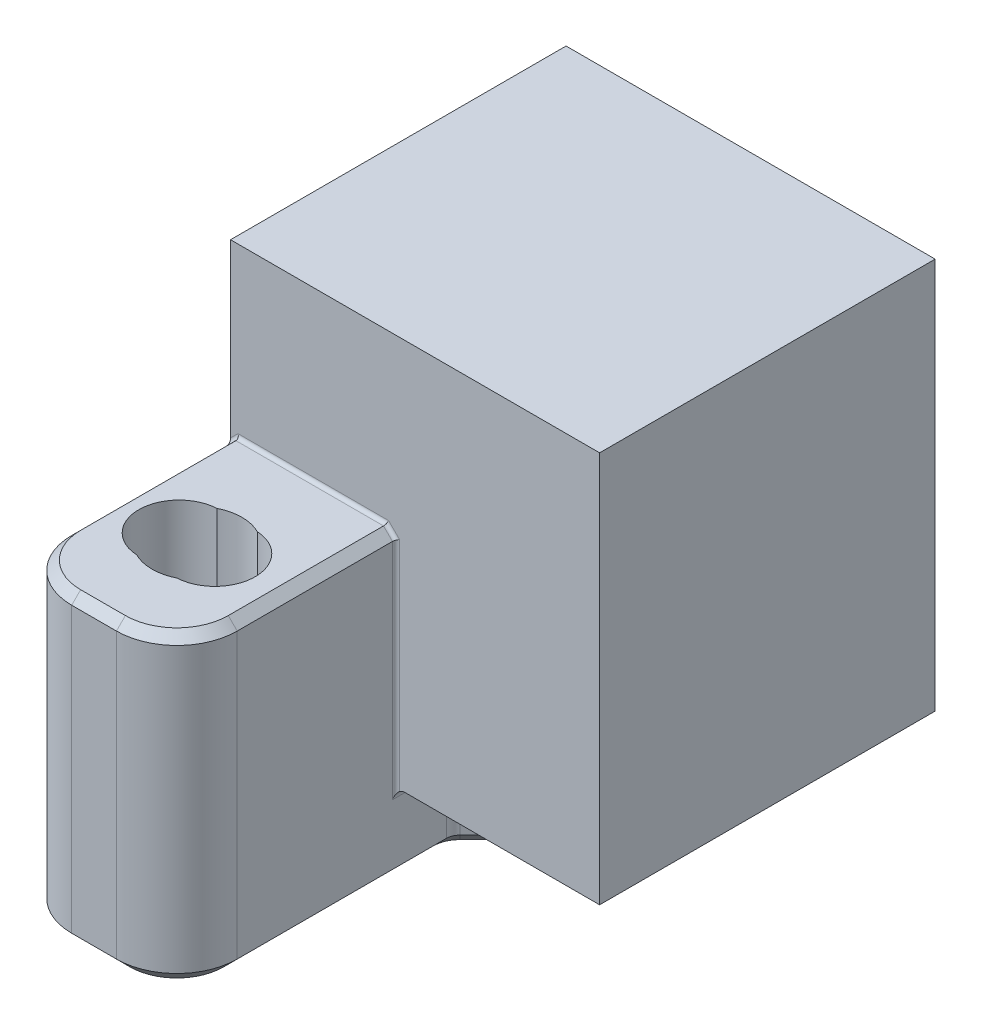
ISO-10303-21;
HEADER;
FILE_DESCRIPTION(('STEP AP214'),'2;1');
FILE_NAME('part.step','',(''),(''),'','','');
FILE_SCHEMA(('AUTOMOTIVE_DESIGN { 1 0 10303 214 1 1 1 1 }'));
ENDSEC;
DATA;
#1=APPLICATION_CONTEXT('core data for automotive mechanical design processes');
#2=APPLICATION_PROTOCOL_DEFINITION('international standard','automotive_design',2000,#1);
#3=PRODUCT_CONTEXT('',#1,'mechanical');
#4=PRODUCT('Part','Part','',(#3));
#5=PRODUCT_RELATED_PRODUCT_CATEGORY('part','',(#4));
#6=PRODUCT_DEFINITION_FORMATION('','',#4);
#7=PRODUCT_DEFINITION_CONTEXT('part definition',#1,'design');
#8=PRODUCT_DEFINITION('design','',#6,#7);
#9=PRODUCT_DEFINITION_SHAPE('','',#8);
#10=(LENGTH_UNIT() NAMED_UNIT(*) SI_UNIT(.MILLI.,.METRE.));
#11=(NAMED_UNIT(*) PLANE_ANGLE_UNIT() SI_UNIT($,.RADIAN.));
#12=(NAMED_UNIT(*) SI_UNIT($,.STERADIAN.) SOLID_ANGLE_UNIT());
#13=UNCERTAINTY_MEASURE_WITH_UNIT(LENGTH_MEASURE(1.E-05),#10,'distance_accuracy_value','');
#14=(GEOMETRIC_REPRESENTATION_CONTEXT(3) GLOBAL_UNCERTAINTY_ASSIGNED_CONTEXT((#13)) GLOBAL_UNIT_ASSIGNED_CONTEXT((#10,
#11,#12)) REPRESENTATION_CONTEXT('',''));
#15=CARTESIAN_POINT('',(0.,0.,0.));
#16=DIRECTION('',(0.,0.,1.));
#17=DIRECTION('',(1.,0.,0.));
#18=AXIS2_PLACEMENT_3D('',#15,#16,#17);
#19=CARTESIAN_POINT('',(0.,0.,9.525));
#20=DIRECTION('',(0.,0.,-1.));
#21=DIRECTION('',(-1.,0.,0.));
#22=AXIS2_PLACEMENT_3D('',#19,#20,#21);
#23=PLANE('',#22);
#24=DIRECTION('',(0.,1.,0.));
#25=VECTOR('',#24,1.);
#26=CARTESIAN_POINT('',(-20.955,-26.924,9.525));
#27=LINE('',#26,#25);
#28=CARTESIAN_POINT('',(-20.955,-9.74563180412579,9.525));
#29=VERTEX_POINT('',#28);
#30=CARTESIAN_POINT('',(-20.955,0.,9.525));
#31=VERTEX_POINT('',#30);
#32=EDGE_CURVE('E413',#29,#31,#27,.T.);
#33=ORIENTED_EDGE('',*,*,#32,.F.);
#34=DIRECTION('',(-0.707106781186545,-0.70710678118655,0.));
#35=VECTOR('',#34,1.);
#36=CARTESIAN_POINT('',(-5.60468409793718,5.60468409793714,9.525));
#37=LINE('',#36,#35);
#38=CARTESIAN_POINT('',(-20.5311681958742,-9.3218,9.525));
#39=VERTEX_POINT('',#38);
#40=EDGE_CURVE('E643',#29,#39,#37,.F.);
#41=ORIENTED_EDGE('',*,*,#40,.T.);
#42=DIRECTION('',(1.,0.,0.));
#43=VECTOR('',#42,1.);
#44=CARTESIAN_POINT('',(0.,-9.3218,9.525));
#45=LINE('',#44,#43);
#46=CARTESIAN_POINT('',(-11.9808318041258,-9.3218,9.525));
#47=VERTEX_POINT('',#46);
#48=EDGE_CURVE('E641',#39,#47,#45,.T.);
#49=ORIENTED_EDGE('',*,*,#48,.T.);
#50=DIRECTION('',(-0.707106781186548,0.707106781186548,0.));
#51=VECTOR('',#50,1.);
#52=CARTESIAN_POINT('',(-10.6513159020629,-10.6513159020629,9.525));
#53=LINE('',#52,#51);
#54=CARTESIAN_POINT('',(-11.3538,-9.94883180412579,9.525));
#55=VERTEX_POINT('',#54);
#56=EDGE_CURVE('E639',#47,#55,#53,.F.);
#57=ORIENTED_EDGE('',*,*,#56,.T.);
#58=DIRECTION('',(0.,-1.,0.));
#59=VECTOR('',#58,1.);
#60=CARTESIAN_POINT('',(-11.3538,0.,9.525));
#61=LINE('',#60,#59);
#62=CARTESIAN_POINT('',(-11.3538,-22.3265999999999,9.525));
#63=VERTEX_POINT('',#62);
#64=EDGE_CURVE('E60',#55,#63,#61,.T.);
#65=ORIENTED_EDGE('',*,*,#64,.T.);
#66=CARTESIAN_POINT('',(-11.049,-22.733,9.525));
#67=DIRECTION('',(0.,0.,-1.));
#68=DIRECTION('',(-1.,0.,0.));
#69=AXIS2_PLACEMENT_3D('',#66,#67,#68);
#70=CIRCLE('',#69,0.508);
#71=CARTESIAN_POINT('',(-11.049,-22.225,9.525));
#72=VERTEX_POINT('',#71);
#73=EDGE_CURVE('E754',#63,#72,#70,.T.);
#74=ORIENTED_EDGE('',*,*,#73,.T.);
#75=DIRECTION('',(-1.,0.,0.));
#76=VECTOR('',#75,1.);
#77=CARTESIAN_POINT('',(0.,-22.225,9.525));
#78=LINE('',#77,#76);
#79=CARTESIAN_POINT('',(0.,-22.225,9.525));
#80=VERTEX_POINT('',#79);
#81=EDGE_CURVE('E409',#80,#72,#78,.T.);
#82=ORIENTED_EDGE('',*,*,#81,.F.);
#83=DIRECTION('',(0.,-1.,0.));
#84=VECTOR('',#83,1.);
#85=CARTESIAN_POINT('',(0.,0.,9.525));
#86=LINE('',#85,#84);
#87=CARTESIAN_POINT('',(0.,0.,9.525));
#88=VERTEX_POINT('',#87);
#89=EDGE_CURVE('E406',#88,#80,#86,.T.);
#90=ORIENTED_EDGE('',*,*,#89,.F.);
#91=DIRECTION('',(1.,0.,0.));
#92=VECTOR('',#91,1.);
#93=CARTESIAN_POINT('',(-20.955,0.,9.525));
#94=LINE('',#93,#92);
#95=EDGE_CURVE('E415',#31,#88,#94,.T.);
#96=ORIENTED_EDGE('',*,*,#95,.F.);
#97=EDGE_LOOP('',(#33,#41,#49,#57,#65,#74,#82,#90,#96));
#98=FACE_BOUND('',#97,.T.);
#99=ADVANCED_FACE('F42',(#98),#23,.F.);
#100=CARTESIAN_POINT('',(0.,0.,9.525));
#101=DIRECTION('',(1.,0.,0.));
#102=DIRECTION('',(0.,1.,0.));
#103=AXIS2_PLACEMENT_3D('',#100,#101,#102);
#104=PLANE('',#103);
#105=DIRECTION('',(0.,-1.,0.));
#106=VECTOR('',#105,1.);
#107=CARTESIAN_POINT('',(0.,0.,-9.525));
#108=LINE('',#107,#106);
#109=CARTESIAN_POINT('',(0.,0.,-9.525));
#110=VERTEX_POINT('',#109);
#111=CARTESIAN_POINT('',(0.,-22.225,-9.525));
#112=VERTEX_POINT('',#111);
#113=EDGE_CURVE('E399',#110,#112,#108,.T.);
#114=ORIENTED_EDGE('',*,*,#113,.F.);
#115=DIRECTION('',(0.,0.,-1.));
#116=VECTOR('',#115,1.);
#117=CARTESIAN_POINT('',(0.,0.,9.525));
#118=LINE('',#117,#116);
#119=EDGE_CURVE('E427',#88,#110,#118,.T.);
#120=ORIENTED_EDGE('',*,*,#119,.F.);
#121=ORIENTED_EDGE('',*,*,#89,.T.);
#122=DIRECTION('',(0.,0.,-1.));
#123=VECTOR('',#122,1.);
#124=CARTESIAN_POINT('',(0.,-22.225,9.525));
#125=LINE('',#124,#123);
#126=EDGE_CURVE('E418',#80,#112,#125,.T.);
#127=ORIENTED_EDGE('',*,*,#126,.T.);
#128=EDGE_LOOP('',(#114,#120,#121,#127));
#129=FACE_BOUND('',#128,.T.);
#130=ADVANCED_FACE('F796',(#129),#104,.T.);
#131=CARTESIAN_POINT('',(-20.955,0.,9.525));
#132=DIRECTION('',(0.,1.,0.));
#133=DIRECTION('',(0.,0.,1.));
#134=AXIS2_PLACEMENT_3D('',#131,#132,#133);
#135=PLANE('',#134);
#136=DIRECTION('',(1.,0.,0.));
#137=VECTOR('',#136,1.);
#138=CARTESIAN_POINT('',(-20.955,0.,-9.525));
#139=LINE('',#138,#137);
#140=CARTESIAN_POINT('',(-20.955,0.,-9.525));
#141=VERTEX_POINT('',#140);
#142=EDGE_CURVE('E410',#141,#110,#139,.T.);
#143=ORIENTED_EDGE('',*,*,#142,.F.);
#144=DIRECTION('',(0.,0.,-1.));
#145=VECTOR('',#144,1.);
#146=CARTESIAN_POINT('',(-20.955,0.,9.525));
#147=LINE('',#146,#145);
#148=EDGE_CURVE('E430',#31,#141,#147,.T.);
#149=ORIENTED_EDGE('',*,*,#148,.F.);
#150=ORIENTED_EDGE('',*,*,#95,.T.);
#151=ORIENTED_EDGE('',*,*,#119,.T.);
#152=EDGE_LOOP('',(#143,#149,#150,#151));
#153=FACE_BOUND('',#152,.T.);
#154=ADVANCED_FACE('F801',(#153),#135,.T.);
#155=CARTESIAN_POINT('',(-20.955,-26.924,9.525));
#156=DIRECTION('',(-1.,0.,0.));
#157=DIRECTION('',(0.,0.,1.));
#158=AXIS2_PLACEMENT_3D('',#155,#156,#157);
#159=PLANE('',#158);
#160=DIRECTION('',(0.,0.,1.));
#161=VECTOR('',#160,1.);
#162=CARTESIAN_POINT('',(-20.955,-23.876,11.2522));
#163=LINE('',#162,#161);
#164=CARTESIAN_POINT('',(-20.955,-23.876,-9.525));
#165=VERTEX_POINT('',#164);
#166=CARTESIAN_POINT('',(-20.955,-23.876,11.6165159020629));
#167=VERTEX_POINT('',#166);
#168=EDGE_CURVE('E587',#165,#167,#163,.T.);
#169=ORIENTED_EDGE('',*,*,#168,.T.);
#170=CARTESIAN_POINT('',(-20.955,-24.1633681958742,11.4728318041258));
#171=DIRECTION('',(-1.,0.,0.));
#172=DIRECTION('',(0.,-0.707106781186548,-0.707106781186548));
#173=AXIS2_PLACEMENT_3D('',#170,#171,#172);
#174=ELLIPSE('',#173,0.351952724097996,0.2032);
#175=CARTESIAN_POINT('',(-20.955,-24.0196840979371,11.7602));
#176=VERTEX_POINT('',#175);
#177=EDGE_CURVE('E692',#167,#176,#174,.F.);
#178=ORIENTED_EDGE('',*,*,#177,.T.);
#179=DIRECTION('',(0.,-1.,0.));
#180=VECTOR('',#179,1.);
#181=CARTESIAN_POINT('',(-20.955,-26.162,11.7602));
#182=LINE('',#181,#180);
#183=CARTESIAN_POINT('',(-20.955,-26.162,11.7602));
#184=VERTEX_POINT('',#183);
#185=EDGE_CURVE('E590',#176,#184,#182,.T.);
#186=ORIENTED_EDGE('',*,*,#185,.T.);
#187=DIRECTION('',(0.,0.,1.));
#188=VECTOR('',#187,1.);
#189=CARTESIAN_POINT('',(-20.955,-26.162,9.525));
#190=LINE('',#189,#188);
#191=CARTESIAN_POINT('',(-20.955,-26.162,18.542));
#192=VERTEX_POINT('',#191);
#193=EDGE_CURVE('E500',#184,#192,#190,.T.);
#194=ORIENTED_EDGE('',*,*,#193,.T.);
#195=DIRECTION('',(0.,-1.,0.));
#196=VECTOR('',#195,1.);
#197=CARTESIAN_POINT('',(-20.955,15.5956827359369,18.542));
#198=LINE('',#197,#196);
#199=CARTESIAN_POINT('',(-20.955,-10.033,18.542));
#200=VERTEX_POINT('',#199);
#201=EDGE_CURVE('E400',#200,#192,#198,.T.);
#202=ORIENTED_EDGE('',*,*,#201,.F.);
#203=DIRECTION('',(0.,0.,-1.));
#204=VECTOR('',#203,1.);
#205=CARTESIAN_POINT('',(-20.955,-10.033,9.525));
#206=LINE('',#205,#204);
#207=CARTESIAN_POINT('',(-20.955,-10.033,9.7282));
#208=VERTEX_POINT('',#207);
#209=EDGE_CURVE('E584',#200,#208,#206,.T.);
#210=ORIENTED_EDGE('',*,*,#209,.T.);
#211=CARTESIAN_POINT('',(-20.955,-9.74563180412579,9.7282));
#212=DIRECTION('',(-1.,0.,0.));
#213=DIRECTION('',(0.,-1.,0.));
#214=AXIS2_PLACEMENT_3D('',#211,#212,#213);
#215=ELLIPSE('',#214,0.287368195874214,0.2032);
#216=EDGE_CURVE('E654',#208,#29,#215,.F.);
#217=ORIENTED_EDGE('',*,*,#216,.T.);
#218=ORIENTED_EDGE('',*,*,#32,.T.);
#219=ORIENTED_EDGE('',*,*,#148,.T.);
#220=DIRECTION('',(0.,1.,0.));
#221=VECTOR('',#220,1.);
#222=CARTESIAN_POINT('',(-20.955,-26.924,-9.525));
#223=LINE('',#222,#221);
#224=EDGE_CURVE('E423',#165,#141,#223,.T.);
#225=ORIENTED_EDGE('',*,*,#224,.F.);
#226=EDGE_LOOP('',(#169,#178,#186,#194,#202,#210,#217,#218,#219,#225));
#227=FACE_BOUND('',#226,.T.);
#228=ADVANCED_FACE('F1075',(#227),#159,.T.);
#229=CARTESIAN_POINT('',(-9.525,-26.924,9.525));
#230=DIRECTION('',(0.,-1.,0.));
#231=DIRECTION('',(0.,0.,-1.));
#232=AXIS2_PLACEMENT_3D('',#229,#230,#231);
#233=PLANE('',#232);
#234=CARTESIAN_POINT('',(-16.51,-26.924,15.875));
#235=DIRECTION('',(0.,1.,0.));
#236=DIRECTION('',(0.,0.,1.));
#237=AXIS2_PLACEMENT_3D('',#234,#235,#236);
#238=CIRCLE('',#237,2.5527);
#239=CARTESIAN_POINT('',(-17.653079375,-26.924,18.1574650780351));
#240=VERTEX_POINT('',#239);
#241=CARTESIAN_POINT('',(-15.366920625,-26.924,18.1574650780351));
#242=VERTEX_POINT('',#241);
#243=EDGE_CURVE('E363',#240,#242,#238,.T.);
#244=ORIENTED_EDGE('',*,*,#243,.T.);
#245=CARTESIAN_POINT('',(-15.494,-26.924,15.875));
#246=DIRECTION('',(0.,-1.,0.));
#247=DIRECTION('',(0.,0.,-1.));
#248=AXIS2_PLACEMENT_3D('',#245,#246,#247);
#249=CIRCLE('',#248,2.286);
#250=CARTESIAN_POINT('',(-15.366920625,-26.924,13.5925349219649));
#251=VERTEX_POINT('',#250);
#252=EDGE_CURVE('E380',#251,#242,#249,.T.);
#253=ORIENTED_EDGE('',*,*,#252,.F.);
#254=CARTESIAN_POINT('',(-17.653079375,-26.924,13.5925349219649));
#255=VERTEX_POINT('',#254);
#256=EDGE_CURVE('E372',#251,#255,#238,.T.);
#257=ORIENTED_EDGE('',*,*,#256,.T.);
#258=CARTESIAN_POINT('',(-17.526,-26.924,15.875));
#259=DIRECTION('',(0.,-1.,0.));
#260=DIRECTION('',(0.,0.,-1.));
#261=AXIS2_PLACEMENT_3D('',#258,#259,#260);
#262=CIRCLE('',#261,2.286);
#263=EDGE_CURVE('E382',#240,#255,#262,.T.);
#264=ORIENTED_EDGE('',*,*,#263,.F.);
#265=EDGE_LOOP('',(#244,#253,#257,#264));
#266=FACE_BOUND('',#265,.T.);
#267=DIRECTION('',(0.,0.,-1.));
#268=VECTOR('',#267,1.);
#269=CARTESIAN_POINT('',(-20.193,-26.924,9.525));
#270=LINE('',#269,#268);
#271=CARTESIAN_POINT('',(-20.193,-26.924,18.542));
#272=VERTEX_POINT('',#271);
#273=CARTESIAN_POINT('',(-20.193,-26.924,12.0142));
#274=VERTEX_POINT('',#273);
#275=EDGE_CURVE('E477',#272,#274,#270,.T.);
#276=ORIENTED_EDGE('',*,*,#275,.T.);
#277=DIRECTION('',(1.,0.,0.));
#278=VECTOR('',#277,1.);
#279=CARTESIAN_POINT('',(-19.1135,-26.924,12.0142));
#280=LINE('',#279,#278);
#281=CARTESIAN_POINT('',(-19.1135,-26.924,12.0142));
#282=VERTEX_POINT('',#281);
#283=EDGE_CURVE('E482',#274,#282,#280,.T.);
#284=ORIENTED_EDGE('',*,*,#283,.T.);
#285=CARTESIAN_POINT('',(-19.1135,-26.924,9.6647));
#286=DIRECTION('',(0.,-1.,0.));
#287=DIRECTION('',(0.,0.,-1.));
#288=AXIS2_PLACEMENT_3D('',#285,#286,#287);
#289=CIRCLE('',#288,2.3495);
#290=CARTESIAN_POINT('',(-16.764,-26.924,9.6647));
#291=VERTEX_POINT('',#290);
#292=EDGE_CURVE('E479',#282,#291,#289,.F.);
#293=ORIENTED_EDGE('',*,*,#292,.T.);
#294=DIRECTION('',(0.,0.,-1.));
#295=VECTOR('',#294,1.);
#296=CARTESIAN_POINT('',(-16.764,-26.924,-9.525));
#297=LINE('',#296,#295);
#298=CARTESIAN_POINT('',(-16.764,-26.924,-8.76299999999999));
#299=VERTEX_POINT('',#298);
#300=EDGE_CURVE('E474',#291,#299,#297,.T.);
#301=ORIENTED_EDGE('',*,*,#300,.T.);
#302=DIRECTION('',(1.,0.,0.));
#303=VECTOR('',#302,1.);
#304=CARTESIAN_POINT('',(-9.525,-26.924,-8.76299999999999));
#305=LINE('',#304,#303);
#306=CARTESIAN_POINT('',(-15.0476307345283,-26.924,-8.76299999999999));
#307=VERTEX_POINT('',#306);
#308=EDGE_CURVE('E472',#299,#307,#305,.T.);
#309=ORIENTED_EDGE('',*,*,#308,.T.);
#310=DIRECTION('',(0.707106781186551,0.,0.707106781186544));
#311=VECTOR('',#310,1.);
#312=CARTESIAN_POINT('',(-10.287,-26.924,-4.00236926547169));
#313=LINE('',#312,#311);
#314=CARTESIAN_POINT('',(-10.287,-26.924,-4.0023692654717));
#315=VERTEX_POINT('',#314);
#316=EDGE_CURVE('E470',#307,#315,#313,.T.);
#317=ORIENTED_EDGE('',*,*,#316,.T.);
#318=DIRECTION('',(0.,0.,1.));
#319=VECTOR('',#318,1.);
#320=CARTESIAN_POINT('',(-10.287,-26.924,9.525));
#321=LINE('',#320,#319);
#322=CARTESIAN_POINT('',(-10.287,-26.924,4.0023692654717));
#323=VERTEX_POINT('',#322);
#324=EDGE_CURVE('E466',#315,#323,#321,.T.);
#325=ORIENTED_EDGE('',*,*,#324,.T.);
#326=DIRECTION('',(-0.707106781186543,0.,0.707106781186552));
#327=VECTOR('',#326,1.);
#328=CARTESIAN_POINT('',(-11.8726307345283,-26.924,5.58800000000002));
#329=LINE('',#328,#327);
#330=CARTESIAN_POINT('',(-11.8726307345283,-26.924,5.58800000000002));
#331=VERTEX_POINT('',#330);
#332=EDGE_CURVE('E462',#323,#331,#329,.T.);
#333=ORIENTED_EDGE('',*,*,#332,.T.);
#334=CARTESIAN_POINT('',(-10.795,-26.924,6.66563073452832));
#335=DIRECTION('',(0.,-1.,0.));
#336=DIRECTION('',(0.,0.,-1.));
#337=AXIS2_PLACEMENT_3D('',#334,#335,#336);
#338=CIRCLE('',#337,1.52400000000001);
#339=CARTESIAN_POINT('',(-12.319,-26.924,6.66563073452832));
#340=VERTEX_POINT('',#339);
#341=EDGE_CURVE('E460',#331,#340,#338,.F.);
#342=ORIENTED_EDGE('',*,*,#341,.T.);
#343=DIRECTION('',(0.,0.,1.));
#344=VECTOR('',#343,1.);
#345=CARTESIAN_POINT('',(-12.319,-26.924,9.525));
#346=LINE('',#345,#344);
#347=CARTESIAN_POINT('',(-12.319,-26.924,18.542));
#348=VERTEX_POINT('',#347);
#349=EDGE_CURVE('E456',#340,#348,#346,.T.);
#350=ORIENTED_EDGE('',*,*,#349,.T.);
#351=CARTESIAN_POINT('',(-14.986,-26.924,18.542));
#352=DIRECTION('',(0.,-1.,0.));
#353=DIRECTION('',(0.,0.,-1.));
#354=AXIS2_PLACEMENT_3D('',#351,#352,#353);
#355=CIRCLE('',#354,2.66700000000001);
#356=CARTESIAN_POINT('',(-14.986,-26.924,21.209));
#357=VERTEX_POINT('',#356);
#358=EDGE_CURVE('E458',#348,#357,#355,.T.);
#359=ORIENTED_EDGE('',*,*,#358,.T.);
#360=DIRECTION('',(-1.,0.,0.));
#361=VECTOR('',#360,1.);
#362=CARTESIAN_POINT('',(-9.525,-26.924,21.209));
#363=LINE('',#362,#361);
#364=CARTESIAN_POINT('',(-17.526,-26.924,21.209));
#365=VERTEX_POINT('',#364);
#366=EDGE_CURVE('E464',#357,#365,#363,.T.);
#367=ORIENTED_EDGE('',*,*,#366,.T.);
#368=CARTESIAN_POINT('',(-17.526,-26.924,18.542));
#369=DIRECTION('',(0.,-1.,0.));
#370=DIRECTION('',(0.,0.,-1.));
#371=AXIS2_PLACEMENT_3D('',#368,#369,#370);
#372=CIRCLE('',#371,2.667);
#373=EDGE_CURVE('E468',#365,#272,#372,.T.);
#374=ORIENTED_EDGE('',*,*,#373,.T.);
#375=EDGE_LOOP('',(#276,#284,#293,#301,#309,#317,#325,#333,#342,#350,#359,#367,#374));
#376=FACE_BOUND('',#375,.T.);
#377=ADVANCED_FACE('F377',(#266,#376),#233,.T.);
#378=CARTESIAN_POINT('',(-9.525,-22.225,9.525));
#379=DIRECTION('',(1.,0.,0.));
#380=DIRECTION('',(0.,0.,-1.));
#381=AXIS2_PLACEMENT_3D('',#378,#379,#380);
#382=PLANE('',#381);
#383=DIRECTION('',(0.,-1.,0.));
#384=VECTOR('',#383,1.);
#385=CARTESIAN_POINT('',(-9.525,-22.225,-4.0023692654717));
#386=LINE('',#385,#384);
#387=CARTESIAN_POINT('',(-9.525,-26.162,-4.0023692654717));
#388=VERTEX_POINT('',#387);
#389=CARTESIAN_POINT('',(-9.525,-22.733,-4.0023692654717));
#390=VERTEX_POINT('',#389);
#391=EDGE_CURVE('E442',#388,#390,#386,.F.);
#392=ORIENTED_EDGE('',*,*,#391,.T.);
#393=DIRECTION('',(0.,0.,-1.));
#394=VECTOR('',#393,1.);
#395=CARTESIAN_POINT('',(-9.525,-22.733,4.0023692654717));
#396=LINE('',#395,#394);
#397=CARTESIAN_POINT('',(-9.525,-22.733,4.0023692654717));
#398=VERTEX_POINT('',#397);
#399=EDGE_CURVE('E744',#390,#398,#396,.F.);
#400=ORIENTED_EDGE('',*,*,#399,.T.);
#401=DIRECTION('',(0.,-1.,0.));
#402=VECTOR('',#401,1.);
#403=CARTESIAN_POINT('',(-9.525,-26.924,4.0023692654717));
#404=LINE('',#403,#402);
#405=CARTESIAN_POINT('',(-9.525,-26.162,4.0023692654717));
#406=VERTEX_POINT('',#405);
#407=EDGE_CURVE('E440',#398,#406,#404,.T.);
#408=ORIENTED_EDGE('',*,*,#407,.T.);
#409=DIRECTION('',(0.,0.,-1.));
#410=VECTOR('',#409,1.);
#411=CARTESIAN_POINT('',(-9.525,-26.162,9.525));
#412=LINE('',#411,#410);
#413=EDGE_CURVE('E518',#406,#388,#412,.T.);
#414=ORIENTED_EDGE('',*,*,#413,.T.);
#415=EDGE_LOOP('',(#392,#400,#408,#414));
#416=FACE_BOUND('',#415,.T.);
#417=ADVANCED_FACE('F930',(#416),#382,.T.);
#418=CARTESIAN_POINT('',(0.,-22.225,9.525));
#419=DIRECTION('',(0.,-1.,0.));
#420=DIRECTION('',(0.,0.,-1.));
#421=AXIS2_PLACEMENT_3D('',#418,#419,#420);
#422=PLANE('',#421);
#423=ORIENTED_EDGE('',*,*,#81,.T.);
#424=DIRECTION('',(0.,0.,1.));
#425=VECTOR('',#424,1.);
#426=CARTESIAN_POINT('',(-11.049,-22.225,6.66563073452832));
#427=LINE('',#426,#425);
#428=CARTESIAN_POINT('',(-11.049,-22.225,6.66563073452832));
#429=VERTEX_POINT('',#428);
#430=EDGE_CURVE('E730',#72,#429,#427,.F.);
#431=ORIENTED_EDGE('',*,*,#430,.T.);
#432=CARTESIAN_POINT('',(-10.795,-22.225,6.66563073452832));
#433=DIRECTION('',(0.,-1.,0.));
#434=DIRECTION('',(0.,0.,-1.));
#435=AXIS2_PLACEMENT_3D('',#432,#433,#434);
#436=CIRCLE('',#435,0.254);
#437=CARTESIAN_POINT('',(-10.9746051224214,-22.225,6.48602561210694));
#438=VERTEX_POINT('',#437);
#439=EDGE_CURVE('E728',#429,#438,#436,.T.);
#440=ORIENTED_EDGE('',*,*,#439,.T.);
#441=DIRECTION('',(-0.707106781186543,0.,0.707106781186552));
#442=VECTOR('',#441,1.);
#443=CARTESIAN_POINT('',(-7.00678975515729,-22.225,2.51821024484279));
#444=LINE('',#443,#442);
#445=CARTESIAN_POINT('',(-9.38897438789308,-22.225,4.90039487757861));
#446=VERTEX_POINT('',#445);
#447=EDGE_CURVE('E726',#438,#446,#444,.F.);
#448=ORIENTED_EDGE('',*,*,#447,.T.);
#449=CARTESIAN_POINT('',(-10.287,-22.225,4.0023692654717));
#450=DIRECTION('',(0.,-1.,0.));
#451=DIRECTION('',(0.,0.,-1.));
#452=AXIS2_PLACEMENT_3D('',#449,#450,#451);
#453=CIRCLE('',#452,1.27);
#454=CARTESIAN_POINT('',(-9.01699999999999,-22.225,4.0023692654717));
#455=VERTEX_POINT('',#454);
#456=EDGE_CURVE('E724',#446,#455,#453,.F.);
#457=ORIENTED_EDGE('',*,*,#456,.T.);
#458=DIRECTION('',(0.,0.,-1.));
#459=VECTOR('',#458,1.);
#460=CARTESIAN_POINT('',(-9.01699999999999,-22.225,-4.0023692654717));
#461=LINE('',#460,#459);
#462=CARTESIAN_POINT('',(-9.01699999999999,-22.225,-4.0023692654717));
#463=VERTEX_POINT('',#462);
#464=EDGE_CURVE('E718',#455,#463,#461,.T.);
#465=ORIENTED_EDGE('',*,*,#464,.T.);
#466=CARTESIAN_POINT('',(-10.287,-22.225,-4.0023692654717));
#467=DIRECTION('',(0.,-1.,0.));
#468=DIRECTION('',(0.,0.,-1.));
#469=AXIS2_PLACEMENT_3D('',#466,#467,#468);
#470=CIRCLE('',#469,1.27);
#471=CARTESIAN_POINT('',(-9.38897438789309,-22.225,-4.90039487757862));
#472=VERTEX_POINT('',#471);
#473=EDGE_CURVE('E720',#463,#472,#470,.F.);
#474=ORIENTED_EDGE('',*,*,#473,.T.);
#475=DIRECTION('',(0.707106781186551,0.,0.707106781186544));
#476=VECTOR('',#475,1.);
#477=CARTESIAN_POINT('',(2.51821024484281,-22.225,7.00678975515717));
#478=LINE('',#477,#476);
#479=CARTESIAN_POINT('',(-14.0135795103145,-22.225,-9.525));
#480=VERTEX_POINT('',#479);
#481=EDGE_CURVE('E722',#472,#480,#478,.F.);
#482=ORIENTED_EDGE('',*,*,#481,.T.);
#483=DIRECTION('',(-1.,0.,0.));
#484=VECTOR('',#483,1.);
#485=CARTESIAN_POINT('',(0.,-22.225,-9.525));
#486=LINE('',#485,#484);
#487=EDGE_CURVE('E421',#112,#480,#486,.T.);
#488=ORIENTED_EDGE('',*,*,#487,.F.);
#489=ORIENTED_EDGE('',*,*,#126,.F.);
#490=EDGE_LOOP('',(#423,#431,#440,#448,#457,#465,#474,#482,#488,#489));
#491=FACE_BOUND('',#490,.T.);
#492=ADVANCED_FACE('F814',(#491),#422,.T.);
#493=CARTESIAN_POINT('',(0.,0.,-9.525));
#494=DIRECTION('',(0.,0.,-1.));
#495=DIRECTION('',(-1.,0.,0.));
#496=AXIS2_PLACEMENT_3D('',#493,#494,#495);
#497=PLANE('',#496);
#498=ORIENTED_EDGE('',*,*,#487,.T.);
#499=CARTESIAN_POINT('',(-14.0135795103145,-22.733,-9.525));
#500=DIRECTION('',(0.,0.,-1.));
#501=DIRECTION('',(1.,0.,0.));
#502=AXIS2_PLACEMENT_3D('',#499,#500,#501);
#503=ELLIPSE('',#502,0.718420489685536,0.508);
#504=CARTESIAN_POINT('',(-14.2856307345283,-22.2628318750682,-9.525));
#505=VERTEX_POINT('',#504);
#506=EDGE_CURVE('E12',#480,#505,#503,.F.);
#507=ORIENTED_EDGE('',*,*,#506,.T.);
#508=CARTESIAN_POINT('',(-14.2856307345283,-22.2628318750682,-9.525));
#509=CARTESIAN_POINT('',(-14.355073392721,-22.2829788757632,-9.525));
#510=CARTESIAN_POINT('',(-14.4219333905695,-22.3098262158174,-9.525));
#511=CARTESIAN_POINT('',(-14.5502993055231,-22.3727475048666,-9.525));
#512=CARTESIAN_POINT('',(-14.6118584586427,-22.4087104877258,-9.525));
#513=CARTESIAN_POINT('',(-14.8018775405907,-22.532489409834,-9.525));
#514=CARTESIAN_POINT('',(-14.9228400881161,-22.6311105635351,-9.525));
#515=CARTESIAN_POINT('',(-15.0447798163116,-22.7306722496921,-9.525));
#516=CARTESIAN_POINT('',(-15.0462052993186,-22.73183615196,-9.525));
#517=CARTESIAN_POINT('',(-15.0476307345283,-22.733,-9.525));
#518=B_SPLINE_CURVE_WITH_KNOTS('',3,(#508,#509,#510,#511,#512,#513,#514,#515,#516,#517),
.UNSPECIFIED.,.F.,.F.,(4,2,2,2,4),(0.,0.215706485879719,0.428903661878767,0.895632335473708,
0.90115320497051),.UNSPECIFIED.);
#519=CARTESIAN_POINT('',(-15.0476307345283,-22.733,-9.525));
#520=VERTEX_POINT('',#519);
#521=EDGE_CURVE('E52',#505,#520,#518,.T.);
#522=ORIENTED_EDGE('',*,*,#521,.T.);
#523=DIRECTION('',(0.,-1.,0.));
#524=VECTOR('',#523,1.);
#525=CARTESIAN_POINT('',(-15.0476307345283,-26.924,-9.525));
#526=LINE('',#525,#524);
#527=CARTESIAN_POINT('',(-15.0476307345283,-26.162,-9.525));
#528=VERTEX_POINT('',#527);
#529=EDGE_CURVE('E429',#520,#528,#526,.T.);
#530=ORIENTED_EDGE('',*,*,#529,.T.);
#531=DIRECTION('',(-1.,0.,0.));
#532=VECTOR('',#531,1.);
#533=CARTESIAN_POINT('',(0.,-26.162,-9.525));
#534=LINE('',#533,#532);
#535=CARTESIAN_POINT('',(-17.018,-26.162,-9.525));
#536=VERTEX_POINT('',#535);
#537=EDGE_CURVE('E512',#528,#536,#534,.T.);
#538=ORIENTED_EDGE('',*,*,#537,.T.);
#539=DIRECTION('',(0.,1.,0.));
#540=VECTOR('',#539,1.);
#541=CARTESIAN_POINT('',(-17.018,-24.384,-9.525));
#542=LINE('',#541,#540);
#543=CARTESIAN_POINT('',(-17.018,-24.0196840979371,-9.525));
#544=VERTEX_POINT('',#543);
#545=EDGE_CURVE('E581',#536,#544,#542,.T.);
#546=ORIENTED_EDGE('',*,*,#545,.T.);
#547=CARTESIAN_POINT('',(-17.3053681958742,-24.1633681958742,-9.525));
#548=DIRECTION('',(0.,0.,-1.));
#549=DIRECTION('',(-0.707106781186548,-0.707106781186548,0.));
#550=AXIS2_PLACEMENT_3D('',#547,#548,#549);
#551=ELLIPSE('',#550,0.351952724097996,0.2032);
#552=CARTESIAN_POINT('',(-17.1616840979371,-23.876,-9.525));
#553=VERTEX_POINT('',#552);
#554=EDGE_CURVE('E690',#544,#553,#551,.F.);
#555=ORIENTED_EDGE('',*,*,#554,.T.);
#556=DIRECTION('',(-1.,0.,0.));
#557=VECTOR('',#556,1.);
#558=CARTESIAN_POINT('',(-20.955,-23.876,-9.525));
#559=LINE('',#558,#557);
#560=EDGE_CURVE('E579',#553,#165,#559,.T.);
#561=ORIENTED_EDGE('',*,*,#560,.T.);
#562=ORIENTED_EDGE('',*,*,#224,.T.);
#563=ORIENTED_EDGE('',*,*,#142,.T.);
#564=ORIENTED_EDGE('',*,*,#113,.T.);
#565=EDGE_LOOP('',(#498,#507,#522,#530,#538,#546,#555,#561,#562,#563,#564));
#566=FACE_BOUND('',#565,.T.);
#567=ADVANCED_FACE('F809',(#566),#497,.T.);
#568=CARTESIAN_POINT('',(-17.526,15.5956827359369,18.542));
#569=DIRECTION('',(0.,-1.,0.));
#570=DIRECTION('',(0.,0.,-1.));
#571=AXIS2_PLACEMENT_3D('',#568,#569,#570);
#572=CYLINDRICAL_SURFACE('',#571,3.429);
#573=DIRECTION('',(0.,-1.,0.));
#574=VECTOR('',#573,1.);
#575=CARTESIAN_POINT('',(-17.526,15.5956827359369,21.971));
#576=LINE('',#575,#574);
#577=CARTESIAN_POINT('',(-17.526,-10.033,21.971));
#578=VERTEX_POINT('',#577);
#579=CARTESIAN_POINT('',(-17.526,-26.162,21.971));
#580=VERTEX_POINT('',#579);
#581=EDGE_CURVE('E402',#578,#580,#576,.T.);
#582=ORIENTED_EDGE('',*,*,#581,.F.);
#583=CARTESIAN_POINT('',(-17.526,-10.033,18.542));
#584=DIRECTION('',(0.,1.,0.));
#585=DIRECTION('',(0.,0.,1.));
#586=AXIS2_PLACEMENT_3D('',#583,#584,#585);
#587=CIRCLE('',#586,3.429);
#588=EDGE_CURVE('E615',#578,#200,#587,.F.);
#589=ORIENTED_EDGE('',*,*,#588,.T.);
#590=ORIENTED_EDGE('',*,*,#201,.T.);
#591=CARTESIAN_POINT('',(-17.526,-26.162,18.542));
#592=DIRECTION('',(0.,-1.,0.));
#593=DIRECTION('',(0.,0.,-1.));
#594=AXIS2_PLACEMENT_3D('',#591,#592,#593);
#595=CIRCLE('',#594,3.429);
#596=EDGE_CURVE('E497',#192,#580,#595,.F.);
#597=ORIENTED_EDGE('',*,*,#596,.T.);
#598=EDGE_LOOP('',(#582,#589,#590,#597));
#599=FACE_BOUND('',#598,.T.);
#600=ADVANCED_FACE('F813',(#599),#572,.T.);
#601=CARTESIAN_POINT('',(-17.526,15.5956827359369,21.971));
#602=DIRECTION('',(0.,0.,1.));
#603=DIRECTION('',(1.,0.,0.));
#604=AXIS2_PLACEMENT_3D('',#601,#602,#603);
#605=PLANE('',#604);
#606=DIRECTION('',(0.,-1.,0.));
#607=VECTOR('',#606,1.);
#608=CARTESIAN_POINT('',(-14.986,15.5956827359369,21.971));
#609=LINE('',#608,#607);
#610=CARTESIAN_POINT('',(-14.986,-10.033,21.971));
#611=VERTEX_POINT('',#610);
#612=CARTESIAN_POINT('',(-14.986,-26.162,21.971));
#613=VERTEX_POINT('',#612);
#614=EDGE_CURVE('E391',#611,#613,#609,.T.);
#615=ORIENTED_EDGE('',*,*,#614,.F.);
#616=DIRECTION('',(-1.,0.,0.));
#617=VECTOR('',#616,1.);
#618=CARTESIAN_POINT('',(-17.526,-10.033,21.971));
#619=LINE('',#618,#617);
#620=EDGE_CURVE('E617',#611,#578,#619,.T.);
#621=ORIENTED_EDGE('',*,*,#620,.T.);
#622=ORIENTED_EDGE('',*,*,#581,.T.);
#623=DIRECTION('',(1.,0.,0.));
#624=VECTOR('',#623,1.);
#625=CARTESIAN_POINT('',(-17.526,-26.162,21.971));
#626=LINE('',#625,#624);
#627=EDGE_CURVE('E484',#580,#613,#626,.T.);
#628=ORIENTED_EDGE('',*,*,#627,.T.);
#629=EDGE_LOOP('',(#615,#621,#622,#628));
#630=FACE_BOUND('',#629,.T.);
#631=ADVANCED_FACE('F1187',(#630),#605,.T.);
#632=CARTESIAN_POINT('',(-14.986,15.5956827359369,18.542));
#633=DIRECTION('',(0.,-1.,0.));
#634=DIRECTION('',(0.,0.,-1.));
#635=AXIS2_PLACEMENT_3D('',#632,#633,#634);
#636=CYLINDRICAL_SURFACE('',#635,3.429);
#637=DIRECTION('',(0.,-1.,0.));
#638=VECTOR('',#637,1.);
#639=CARTESIAN_POINT('',(-11.557,15.5956827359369,18.542));
#640=LINE('',#639,#638);
#641=CARTESIAN_POINT('',(-11.557,-10.033,18.542));
#642=VERTEX_POINT('',#641);
#643=CARTESIAN_POINT('',(-11.557,-26.162,18.542));
#644=VERTEX_POINT('',#643);
#645=EDGE_CURVE('E387',#642,#644,#640,.T.);
#646=ORIENTED_EDGE('',*,*,#645,.F.);
#647=CARTESIAN_POINT('',(-14.986,-10.033,18.542));
#648=DIRECTION('',(0.,1.,0.));
#649=DIRECTION('',(0.,0.,1.));
#650=AXIS2_PLACEMENT_3D('',#647,#648,#649);
#651=CIRCLE('',#650,3.429);
#652=EDGE_CURVE('E619',#642,#611,#651,.F.);
#653=ORIENTED_EDGE('',*,*,#652,.T.);
#654=ORIENTED_EDGE('',*,*,#614,.T.);
#655=CARTESIAN_POINT('',(-14.986,-26.162,18.542));
#656=DIRECTION('',(0.,-1.,0.));
#657=DIRECTION('',(0.,0.,-1.));
#658=AXIS2_PLACEMENT_3D('',#655,#656,#657);
#659=CIRCLE('',#658,3.429);
#660=EDGE_CURVE('E520',#613,#644,#659,.F.);
#661=ORIENTED_EDGE('',*,*,#660,.T.);
#662=EDGE_LOOP('',(#646,#653,#654,#661));
#663=FACE_BOUND('',#662,.T.);
#664=ADVANCED_FACE('F1103',(#663),#636,.T.);
#665=CARTESIAN_POINT('',(-11.557,15.5956827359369,9.525));
#666=DIRECTION('',(1.,0.,0.));
#667=DIRECTION('',(0.,0.,-1.));
#668=AXIS2_PLACEMENT_3D('',#665,#666,#667);
#669=PLANE('',#668);
#670=DIRECTION('',(0.,-1.,0.));
#671=VECTOR('',#670,1.);
#672=CARTESIAN_POINT('',(-11.557,15.5956827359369,6.66563073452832));
#673=LINE('',#672,#671);
#674=CARTESIAN_POINT('',(-11.557,-26.162,6.66563073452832));
#675=VERTEX_POINT('',#674);
#676=CARTESIAN_POINT('',(-11.557,-22.733,6.66563073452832));
#677=VERTEX_POINT('',#676);
#678=EDGE_CURVE('E450',#675,#677,#673,.F.);
#679=ORIENTED_EDGE('',*,*,#678,.T.);
#680=DIRECTION('',(0.,0.,1.));
#681=VECTOR('',#680,1.);
#682=CARTESIAN_POINT('',(-11.557,-22.733,9.7282));
#683=LINE('',#682,#681);
#684=CARTESIAN_POINT('',(-11.557,-22.733,9.7282));
#685=VERTEX_POINT('',#684);
#686=EDGE_CURVE('E715',#677,#685,#683,.T.);
#687=ORIENTED_EDGE('',*,*,#686,.T.);
#688=DIRECTION('',(0.,-1.,0.));
#689=VECTOR('',#688,1.);
#690=CARTESIAN_POINT('',(-11.557,15.5956827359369,9.7282));
#691=LINE('',#690,#689);
#692=CARTESIAN_POINT('',(-11.557,-10.033,9.7282));
#693=VERTEX_POINT('',#692);
#694=EDGE_CURVE('E652',#685,#693,#691,.F.);
#695=ORIENTED_EDGE('',*,*,#694,.T.);
#696=DIRECTION('',(0.,0.,1.));
#697=VECTOR('',#696,1.);
#698=CARTESIAN_POINT('',(-11.557,-10.033,9.525));
#699=LINE('',#698,#697);
#700=EDGE_CURVE('E621',#693,#642,#699,.T.);
#701=ORIENTED_EDGE('',*,*,#700,.T.);
#702=ORIENTED_EDGE('',*,*,#645,.T.);
#703=DIRECTION('',(0.,0.,-1.));
#704=VECTOR('',#703,1.);
#705=CARTESIAN_POINT('',(-11.557,-26.162,9.525));
#706=LINE('',#705,#704);
#707=EDGE_CURVE('E523',#644,#675,#706,.T.);
#708=ORIENTED_EDGE('',*,*,#707,.T.);
#709=EDGE_LOOP('',(#679,#687,#695,#701,#702,#708));
#710=FACE_BOUND('',#709,.T.);
#711=ADVANCED_FACE('F1101',(#710),#669,.T.);
#712=CARTESIAN_POINT('',(-15.494,15.5956827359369,15.875));
#713=DIRECTION('',(0.,-1.,0.));
#714=DIRECTION('',(0.,0.,-1.));
#715=AXIS2_PLACEMENT_3D('',#712,#713,#714);
#716=CYLINDRICAL_SURFACE('',#715,2.286);
#717=CARTESIAN_POINT('',(-15.494,-9.525,15.875));
#718=DIRECTION('',(0.,1.,0.));
#719=DIRECTION('',(0.,0.,1.));
#720=AXIS2_PLACEMENT_3D('',#717,#718,#719);
#721=CIRCLE('',#720,2.286);
#722=CARTESIAN_POINT('',(-15.366920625,-9.525,13.5925349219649));
#723=VERTEX_POINT('',#722);
#724=CARTESIAN_POINT('',(-15.366920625,-9.525,18.1574650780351));
#725=VERTEX_POINT('',#724);
#726=EDGE_CURVE('E389',#723,#725,#721,.F.);
#727=ORIENTED_EDGE('',*,*,#726,.F.);
#728=DIRECTION('',(0.,1.,0.));
#729=VECTOR('',#728,1.);
#730=CARTESIAN_POINT('',(-15.366920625,-18.2245,13.5925349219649));
#731=LINE('',#730,#729);
#732=EDGE_CURVE('E371',#723,#251,#731,.F.);
#733=ORIENTED_EDGE('',*,*,#732,.T.);
#734=ORIENTED_EDGE('',*,*,#252,.T.);
#735=DIRECTION('',(0.,1.,0.));
#736=VECTOR('',#735,1.);
#737=CARTESIAN_POINT('',(-15.366920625,-18.2245,18.1574650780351));
#738=LINE('',#737,#736);
#739=EDGE_CURVE('E360',#242,#725,#738,.T.);
#740=ORIENTED_EDGE('',*,*,#739,.T.);
#741=EDGE_LOOP('',(#727,#733,#734,#740));
#742=FACE_BOUND('',#741,.T.);
#743=ADVANCED_FACE('F386',(#742),#716,.F.);
#744=CARTESIAN_POINT('',(-17.526,15.5956827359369,15.875));
#745=DIRECTION('',(0.,-1.,0.));
#746=DIRECTION('',(0.,0.,-1.));
#747=AXIS2_PLACEMENT_3D('',#744,#745,#746);
#748=CYLINDRICAL_SURFACE('',#747,2.286);
#749=CARTESIAN_POINT('',(-17.526,-9.525,15.875));
#750=DIRECTION('',(0.,1.,0.));
#751=DIRECTION('',(0.,0.,1.));
#752=AXIS2_PLACEMENT_3D('',#749,#750,#751);
#753=CIRCLE('',#752,2.286);
#754=CARTESIAN_POINT('',(-17.653079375,-9.525,18.1574650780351));
#755=VERTEX_POINT('',#754);
#756=CARTESIAN_POINT('',(-17.653079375,-9.525,13.5925349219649));
#757=VERTEX_POINT('',#756);
#758=EDGE_CURVE('E396',#755,#757,#753,.F.);
#759=ORIENTED_EDGE('',*,*,#758,.F.);
#760=DIRECTION('',(0.,1.,0.));
#761=VECTOR('',#760,1.);
#762=CARTESIAN_POINT('',(-17.653079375,-18.2245,18.1574650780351));
#763=LINE('',#762,#761);
#764=EDGE_CURVE('E713',#755,#240,#763,.F.);
#765=ORIENTED_EDGE('',*,*,#764,.T.);
#766=ORIENTED_EDGE('',*,*,#263,.T.);
#767=DIRECTION('',(0.,1.,0.));
#768=VECTOR('',#767,1.);
#769=CARTESIAN_POINT('',(-17.653079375,-18.2245,13.5925349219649));
#770=LINE('',#769,#768);
#771=EDGE_CURVE('E699',#255,#757,#770,.T.);
#772=ORIENTED_EDGE('',*,*,#771,.T.);
#773=EDGE_LOOP('',(#759,#765,#766,#772));
#774=FACE_BOUND('',#773,.T.);
#775=ADVANCED_FACE('F1193',(#774),#748,.F.);
#776=CARTESIAN_POINT('',(-20.955,-9.525,9.525));
#777=DIRECTION('',(0.,1.,0.));
#778=DIRECTION('',(0.,0.,1.));
#779=AXIS2_PLACEMENT_3D('',#776,#777,#778);
#780=PLANE('',#779);
#781=CARTESIAN_POINT('',(-16.51,-9.525,15.875));
#782=DIRECTION('',(0.,1.,0.));
#783=DIRECTION('',(0.,0.,1.));
#784=AXIS2_PLACEMENT_3D('',#781,#782,#783);
#785=CIRCLE('',#784,2.5527);
#786=EDGE_CURVE('E383',#723,#757,#785,.T.);
#787=ORIENTED_EDGE('',*,*,#786,.F.);
#788=ORIENTED_EDGE('',*,*,#726,.T.);
#789=EDGE_CURVE('E366',#755,#725,#785,.T.);
#790=ORIENTED_EDGE('',*,*,#789,.F.);
#791=ORIENTED_EDGE('',*,*,#758,.T.);
#792=EDGE_LOOP('',(#787,#788,#790,#791));
#793=FACE_BOUND('',#792,.T.);
#794=DIRECTION('',(0.,0.,-1.));
#795=VECTOR('',#794,1.);
#796=CARTESIAN_POINT('',(-12.065,-9.525,9.525));
#797=LINE('',#796,#795);
#798=CARTESIAN_POINT('',(-12.065,-9.525,18.542));
#799=VERTEX_POINT('',#798);
#800=CARTESIAN_POINT('',(-12.065,-9.525,9.7282));
#801=VERTEX_POINT('',#800);
#802=EDGE_CURVE('E604',#799,#801,#797,.T.);
#803=ORIENTED_EDGE('',*,*,#802,.T.);
#804=DIRECTION('',(1.,0.,0.));
#805=VECTOR('',#804,1.);
#806=CARTESIAN_POINT('',(-20.955,-9.525,9.7282));
#807=LINE('',#806,#805);
#808=CARTESIAN_POINT('',(-20.447,-9.525,9.7282));
#809=VERTEX_POINT('',#808);
#810=EDGE_CURVE('E650',#801,#809,#807,.F.);
#811=ORIENTED_EDGE('',*,*,#810,.T.);
#812=DIRECTION('',(0.,0.,1.));
#813=VECTOR('',#812,1.);
#814=CARTESIAN_POINT('',(-20.447,-9.525,9.525));
#815=LINE('',#814,#813);
#816=CARTESIAN_POINT('',(-20.447,-9.525,18.542));
#817=VERTEX_POINT('',#816);
#818=EDGE_CURVE('E613',#809,#817,#815,.T.);
#819=ORIENTED_EDGE('',*,*,#818,.T.);
#820=CARTESIAN_POINT('',(-17.526,-9.525,18.542));
#821=DIRECTION('',(0.,1.,0.));
#822=DIRECTION('',(0.,0.,1.));
#823=AXIS2_PLACEMENT_3D('',#820,#821,#822);
#824=CIRCLE('',#823,2.921);
#825=CARTESIAN_POINT('',(-17.526,-9.525,21.463));
#826=VERTEX_POINT('',#825);
#827=EDGE_CURVE('E611',#817,#826,#824,.T.);
#828=ORIENTED_EDGE('',*,*,#827,.T.);
#829=DIRECTION('',(1.,0.,0.));
#830=VECTOR('',#829,1.);
#831=CARTESIAN_POINT('',(-20.955,-9.525,21.463));
#832=LINE('',#831,#830);
#833=CARTESIAN_POINT('',(-14.986,-9.525,21.463));
#834=VERTEX_POINT('',#833);
#835=EDGE_CURVE('E609',#826,#834,#832,.T.);
#836=ORIENTED_EDGE('',*,*,#835,.T.);
#837=CARTESIAN_POINT('',(-14.986,-9.525,18.542));
#838=DIRECTION('',(0.,1.,0.));
#839=DIRECTION('',(0.,0.,1.));
#840=AXIS2_PLACEMENT_3D('',#837,#838,#839);
#841=CIRCLE('',#840,2.921);
#842=EDGE_CURVE('E607',#834,#799,#841,.T.);
#843=ORIENTED_EDGE('',*,*,#842,.T.);
#844=EDGE_LOOP('',(#803,#811,#819,#828,#836,#843));
#845=FACE_BOUND('',#844,.T.);
#846=ADVANCED_FACE('F807',(#793,#845),#780,.T.);
#847=CARTESIAN_POINT('',(-20.955,-24.384,11.2522));
#848=DIRECTION('',(0.,0.,1.));
#849=DIRECTION('',(1.,0.,0.));
#850=AXIS2_PLACEMENT_3D('',#847,#848,#849);
#851=PLANE('',#850);
#852=DIRECTION('',(0.,1.,0.));
#853=VECTOR('',#852,1.);
#854=CARTESIAN_POINT('',(-20.447,-24.384,11.2522));
#855=LINE('',#854,#853);
#856=CARTESIAN_POINT('',(-20.447,-26.162,11.2522));
#857=VERTEX_POINT('',#856);
#858=CARTESIAN_POINT('',(-20.447,-24.5872,11.2522));
#859=VERTEX_POINT('',#858);
#860=EDGE_CURVE('E596',#857,#859,#855,.T.);
#861=ORIENTED_EDGE('',*,*,#860,.T.);
#862=DIRECTION('',(-1.,0.,0.));
#863=VECTOR('',#862,1.);
#864=CARTESIAN_POINT('',(-19.1135,-24.5872,11.2522));
#865=LINE('',#864,#863);
#866=CARTESIAN_POINT('',(-19.1135,-24.5872,11.2522));
#867=VERTEX_POINT('',#866);
#868=EDGE_CURVE('E671',#859,#867,#865,.F.);
#869=ORIENTED_EDGE('',*,*,#868,.T.);
#870=DIRECTION('',(0.,-1.,0.));
#871=VECTOR('',#870,1.);
#872=CARTESIAN_POINT('',(-19.1135,-24.384,11.2522));
#873=LINE('',#872,#871);
#874=CARTESIAN_POINT('',(-19.1135,-26.162,11.2522));
#875=VERTEX_POINT('',#874);
#876=EDGE_CURVE('E403',#867,#875,#873,.T.);
#877=ORIENTED_EDGE('',*,*,#876,.T.);
#878=DIRECTION('',(-1.,0.,0.));
#879=VECTOR('',#878,1.);
#880=CARTESIAN_POINT('',(-20.955,-26.162,11.2522));
#881=LINE('',#880,#879);
#882=EDGE_CURVE('E503',#875,#857,#881,.T.);
#883=ORIENTED_EDGE('',*,*,#882,.T.);
#884=EDGE_LOOP('',(#861,#869,#877,#883));
#885=FACE_BOUND('',#884,.T.);
#886=ADVANCED_FACE('F875',(#885),#851,.F.);
#887=CARTESIAN_POINT('',(-19.1135,-24.384,9.6647));
#888=DIRECTION('',(0.,-1.,0.));
#889=DIRECTION('',(0.,0.,-1.));
#890=AXIS2_PLACEMENT_3D('',#887,#888,#889);
#891=CYLINDRICAL_SURFACE('',#890,1.5875);
#892=ORIENTED_EDGE('',*,*,#876,.F.);
#893=CARTESIAN_POINT('',(-19.1135,-24.5872,9.6647));
#894=DIRECTION('',(0.,1.,0.));
#895=DIRECTION('',(0.,0.,1.));
#896=AXIS2_PLACEMENT_3D('',#893,#894,#895);
#897=CIRCLE('',#896,1.5875);
#898=CARTESIAN_POINT('',(-17.526,-24.5872,9.6647));
#899=VERTEX_POINT('',#898);
#900=EDGE_CURVE('E673',#867,#899,#897,.T.);
#901=ORIENTED_EDGE('',*,*,#900,.T.);
#902=DIRECTION('',(0.,-1.,0.));
#903=VECTOR('',#902,1.);
#904=CARTESIAN_POINT('',(-17.526,-24.384,9.6647));
#905=LINE('',#904,#903);
#906=CARTESIAN_POINT('',(-17.526,-26.162,9.6647));
#907=VERTEX_POINT('',#906);
#908=EDGE_CURVE('E573',#899,#907,#905,.T.);
#909=ORIENTED_EDGE('',*,*,#908,.T.);
#910=CARTESIAN_POINT('',(-19.1135,-26.162,9.6647));
#911=DIRECTION('',(0.,-1.,0.));
#912=DIRECTION('',(0.,0.,-1.));
#913=AXIS2_PLACEMENT_3D('',#910,#911,#912);
#914=CIRCLE('',#913,1.5875);
#915=EDGE_CURVE('E453',#907,#875,#914,.T.);
#916=ORIENTED_EDGE('',*,*,#915,.T.);
#917=EDGE_LOOP('',(#892,#901,#909,#916));
#918=FACE_BOUND('',#917,.T.);
#919=ADVANCED_FACE('F851',(#918),#891,.F.);
#920=CARTESIAN_POINT('',(-17.526,-24.384,-9.525));
#921=DIRECTION('',(1.,0.,0.));
#922=DIRECTION('',(0.,0.,-1.));
#923=AXIS2_PLACEMENT_3D('',#920,#921,#922);
#924=PLANE('',#923);
#925=ORIENTED_EDGE('',*,*,#908,.F.);
#926=DIRECTION('',(0.,0.,1.));
#927=VECTOR('',#926,1.);
#928=CARTESIAN_POINT('',(-17.526,-24.5872,-9.01699999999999));
#929=LINE('',#928,#927);
#930=CARTESIAN_POINT('',(-17.526,-24.5872,-9.01699999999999));
#931=VERTEX_POINT('',#930);
#932=EDGE_CURVE('E683',#899,#931,#929,.F.);
#933=ORIENTED_EDGE('',*,*,#932,.T.);
#934=DIRECTION('',(0.,-1.,0.));
#935=VECTOR('',#934,1.);
#936=CARTESIAN_POINT('',(-17.526,-26.162,-9.01699999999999));
#937=LINE('',#936,#935);
#938=CARTESIAN_POINT('',(-17.526,-26.162,-9.01699999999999));
#939=VERTEX_POINT('',#938);
#940=EDGE_CURVE('E525',#931,#939,#937,.T.);
#941=ORIENTED_EDGE('',*,*,#940,.T.);
#942=DIRECTION('',(0.,0.,1.));
#943=VECTOR('',#942,1.);
#944=CARTESIAN_POINT('',(-17.526,-26.162,9.6647));
#945=LINE('',#944,#943);
#946=EDGE_CURVE('E506',#939,#907,#945,.T.);
#947=ORIENTED_EDGE('',*,*,#946,.T.);
#948=EDGE_LOOP('',(#925,#933,#941,#947));
#949=FACE_BOUND('',#948,.T.);
#950=ADVANCED_FACE('F858',(#949),#924,.F.);
#951=CARTESIAN_POINT('',(-19.1135,-24.384,9.6647));
#952=DIRECTION('',(0.,1.,0.));
#953=DIRECTION('',(0.,0.,1.));
#954=AXIS2_PLACEMENT_3D('',#951,#952,#953);
#955=PLANE('',#954);
#956=CARTESIAN_POINT('',(-19.1135,-24.384,9.6647));
#957=DIRECTION('',(0.,1.,0.));
#958=DIRECTION('',(0.,0.,1.));
#959=AXIS2_PLACEMENT_3D('',#956,#957,#958);
#960=CIRCLE('',#959,1.3843);
#961=CARTESIAN_POINT('',(-17.7292,-24.384,9.6647));
#962=VERTEX_POINT('',#961);
#963=CARTESIAN_POINT('',(-19.1135,-24.384,11.049));
#964=VERTEX_POINT('',#963);
#965=EDGE_CURVE('E666',#962,#964,#960,.F.);
#966=ORIENTED_EDGE('',*,*,#965,.T.);
#967=DIRECTION('',(-1.,0.,0.));
#968=VECTOR('',#967,1.);
#969=CARTESIAN_POINT('',(-20.447,-24.384,11.049));
#970=LINE('',#969,#968);
#971=CARTESIAN_POINT('',(-20.447,-24.384,11.049));
#972=VERTEX_POINT('',#971);
#973=EDGE_CURVE('E668',#964,#972,#970,.T.);
#974=ORIENTED_EDGE('',*,*,#973,.T.);
#975=DIRECTION('',(0.,0.,-1.));
#976=VECTOR('',#975,1.);
#977=CARTESIAN_POINT('',(-20.447,-24.384,-9.525));
#978=LINE('',#977,#976);
#979=CARTESIAN_POINT('',(-20.447,-24.384,-9.01699999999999));
#980=VERTEX_POINT('',#979);
#981=EDGE_CURVE('E599',#972,#980,#978,.T.);
#982=ORIENTED_EDGE('',*,*,#981,.T.);
#983=DIRECTION('',(1.,0.,0.));
#984=VECTOR('',#983,1.);
#985=CARTESIAN_POINT('',(-17.526,-24.384,-9.01699999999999));
#986=LINE('',#985,#984);
#987=CARTESIAN_POINT('',(-17.7292,-24.384,-9.01699999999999));
#988=VERTEX_POINT('',#987);
#989=EDGE_CURVE('E601',#980,#988,#986,.T.);
#990=ORIENTED_EDGE('',*,*,#989,.T.);
#991=DIRECTION('',(0.,0.,1.));
#992=VECTOR('',#991,1.);
#993=CARTESIAN_POINT('',(-17.7292,-24.384,9.6647));
#994=LINE('',#993,#992);
#995=EDGE_CURVE('E656',#988,#962,#994,.T.);
#996=ORIENTED_EDGE('',*,*,#995,.T.);
#997=EDGE_LOOP('',(#966,#974,#982,#990,#996));
#998=FACE_BOUND('',#997,.T.);
#999=ADVANCED_FACE('F1173',(#998),#955,.F.);
#1000=CARTESIAN_POINT('',(-11.557,-14.8611899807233,6.35000000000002));
#1001=DIRECTION('',(-0.707106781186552,0.,-0.707106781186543));
#1002=DIRECTION('',(-0.707106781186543,0.,0.707106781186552));
#1003=AXIS2_PLACEMENT_3D('',#1000,#1001,#1002);
#1004=PLANE('',#1003);
#1005=DIRECTION('',(0.,-1.,0.));
#1006=VECTOR('',#1005,1.);
#1007=CARTESIAN_POINT('',(-9.74818463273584,-22.225,4.54118463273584));
#1008=LINE('',#1007,#1006);
#1009=CARTESIAN_POINT('',(-9.74818463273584,-26.162,4.54118463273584));
#1010=VERTEX_POINT('',#1009);
#1011=CARTESIAN_POINT('',(-9.74818463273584,-22.733,4.54118463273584));
#1012=VERTEX_POINT('',#1011);
#1013=EDGE_CURVE('E447',#1010,#1012,#1008,.F.);
#1014=ORIENTED_EDGE('',*,*,#1013,.T.);
#1015=DIRECTION('',(-0.707106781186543,0.,0.707106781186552));
#1016=VECTOR('',#1015,1.);
#1017=CARTESIAN_POINT('',(-11.557,-22.733,6.35000000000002));
#1018=LINE('',#1017,#1016);
#1019=CARTESIAN_POINT('',(-11.3338153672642,-22.733,6.12681536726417));
#1020=VERTEX_POINT('',#1019);
#1021=EDGE_CURVE('E734',#1012,#1020,#1018,.T.);
#1022=ORIENTED_EDGE('',*,*,#1021,.T.);
#1023=DIRECTION('',(0.,-1.,0.));
#1024=VECTOR('',#1023,1.);
#1025=CARTESIAN_POINT('',(-11.3338153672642,-14.8611899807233,6.12681536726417));
#1026=LINE('',#1025,#1024);
#1027=CARTESIAN_POINT('',(-11.3338153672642,-26.162,6.12681536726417));
#1028=VERTEX_POINT('',#1027);
#1029=EDGE_CURVE('E445',#1020,#1028,#1026,.T.);
#1030=ORIENTED_EDGE('',*,*,#1029,.T.);
#1031=DIRECTION('',(0.707106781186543,0.,-0.707106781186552));
#1032=VECTOR('',#1031,1.);
#1033=CARTESIAN_POINT('',(-9.74818463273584,-26.162,4.54118463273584));
#1034=LINE('',#1033,#1032);
#1035=EDGE_CURVE('E490',#1028,#1010,#1034,.T.);
#1036=ORIENTED_EDGE('',*,*,#1035,.T.);
#1037=EDGE_LOOP('',(#1014,#1022,#1030,#1036));
#1038=FACE_BOUND('',#1037,.T.);
#1039=ADVANCED_FACE('F1127',(#1038),#1004,.F.);
#1040=CARTESIAN_POINT('',(-9.525,-14.8611899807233,-4.318));
#1041=DIRECTION('',(-0.707106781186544,0.,0.707106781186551));
#1042=DIRECTION('',(0.707106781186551,0.,0.707106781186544));
#1043=AXIS2_PLACEMENT_3D('',#1040,#1041,#1042);
#1044=PLANE('',#1043);
#1045=DIRECTION('',(0.,-1.,0.));
#1046=VECTOR('',#1045,1.);
#1047=CARTESIAN_POINT('',(-14.5088153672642,-22.225,-9.30181536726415));
#1048=LINE('',#1047,#1046);
#1049=CARTESIAN_POINT('',(-14.5088153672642,-26.162,-9.30181536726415));
#1050=VERTEX_POINT('',#1049);
#1051=CARTESIAN_POINT('',(-14.5088153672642,-22.733,-9.30181536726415));
#1052=VERTEX_POINT('',#1051);
#1053=EDGE_CURVE('E437',#1050,#1052,#1048,.F.);
#1054=ORIENTED_EDGE('',*,*,#1053,.T.);
#1055=DIRECTION('',(0.707106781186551,0.,0.707106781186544));
#1056=VECTOR('',#1055,1.);
#1057=CARTESIAN_POINT('',(-9.525,-22.733,-4.318));
#1058=LINE('',#1057,#1056);
#1059=CARTESIAN_POINT('',(-9.74818463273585,-22.733,-4.54118463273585));
#1060=VERTEX_POINT('',#1059);
#1061=EDGE_CURVE('E740',#1052,#1060,#1058,.T.);
#1062=ORIENTED_EDGE('',*,*,#1061,.T.);
#1063=DIRECTION('',(0.,-1.,0.));
#1064=VECTOR('',#1063,1.);
#1065=CARTESIAN_POINT('',(-9.74818463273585,-26.924,-4.54118463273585));
#1066=LINE('',#1065,#1064);
#1067=CARTESIAN_POINT('',(-9.74818463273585,-26.162,-4.54118463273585));
#1068=VERTEX_POINT('',#1067);
#1069=EDGE_CURVE('E435',#1060,#1068,#1066,.T.);
#1070=ORIENTED_EDGE('',*,*,#1069,.T.);
#1071=DIRECTION('',(-0.707106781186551,0.,-0.707106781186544));
#1072=VECTOR('',#1071,1.);
#1073=CARTESIAN_POINT('',(-14.5088153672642,-26.162,-9.30181536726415));
#1074=LINE('',#1073,#1072);
#1075=EDGE_CURVE('E495',#1068,#1050,#1074,.T.);
#1076=ORIENTED_EDGE('',*,*,#1075,.T.);
#1077=EDGE_LOOP('',(#1054,#1062,#1070,#1076));
#1078=FACE_BOUND('',#1077,.T.);
#1079=ADVANCED_FACE('F917',(#1078),#1044,.F.);
#1080=CARTESIAN_POINT('',(-15.0476307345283,0.,-8.763));
#1081=DIRECTION('',(0.,1.,0.));
#1082=DIRECTION('',(0.,0.,1.));
#1083=AXIS2_PLACEMENT_3D('',#1080,#1081,#1082);
#1084=CYLINDRICAL_SURFACE('',#1083,0.762);
#1085=ORIENTED_EDGE('',*,*,#529,.F.);
#1086=CARTESIAN_POINT('',(-15.0476307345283,-22.733,-8.763));
#1087=DIRECTION('',(0.,-1.,0.));
#1088=DIRECTION('',(0.,0.,-1.));
#1089=AXIS2_PLACEMENT_3D('',#1086,#1087,#1088);
#1090=CIRCLE('',#1089,0.762);
#1091=EDGE_CURVE('E738',#520,#1052,#1090,.T.);
#1092=ORIENTED_EDGE('',*,*,#1091,.T.);
#1093=ORIENTED_EDGE('',*,*,#1053,.F.);
#1094=CARTESIAN_POINT('',(-15.0476307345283,-26.162,-8.763));
#1095=DIRECTION('',(0.,-1.,0.));
#1096=DIRECTION('',(0.,0.,-1.));
#1097=AXIS2_PLACEMENT_3D('',#1094,#1095,#1096);
#1098=CIRCLE('',#1097,0.762);
#1099=EDGE_CURVE('E509',#1050,#528,#1098,.F.);
#1100=ORIENTED_EDGE('',*,*,#1099,.T.);
#1101=EDGE_LOOP('',(#1085,#1092,#1093,#1100));
#1102=FACE_BOUND('',#1101,.T.);
#1103=ADVANCED_FACE('F914',(#1102),#1084,.T.);
#1104=CARTESIAN_POINT('',(-10.287,-14.8611899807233,-4.0023692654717));
#1105=DIRECTION('',(0.,1.,0.));
#1106=DIRECTION('',(0.,0.,1.));
#1107=AXIS2_PLACEMENT_3D('',#1104,#1105,#1106);
#1108=CYLINDRICAL_SURFACE('',#1107,0.762);
#1109=ORIENTED_EDGE('',*,*,#1069,.F.);
#1110=CARTESIAN_POINT('',(-10.287,-22.733,-4.0023692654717));
#1111=DIRECTION('',(0.,-1.,0.));
#1112=DIRECTION('',(0.,0.,-1.));
#1113=AXIS2_PLACEMENT_3D('',#1110,#1111,#1112);
#1114=CIRCLE('',#1113,0.762);
#1115=EDGE_CURVE('E742',#1060,#390,#1114,.T.);
#1116=ORIENTED_EDGE('',*,*,#1115,.T.);
#1117=ORIENTED_EDGE('',*,*,#391,.F.);
#1118=CARTESIAN_POINT('',(-10.287,-26.162,-4.0023692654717));
#1119=DIRECTION('',(0.,-1.,0.));
#1120=DIRECTION('',(0.,0.,-1.));
#1121=AXIS2_PLACEMENT_3D('',#1118,#1119,#1120);
#1122=CIRCLE('',#1121,0.762);
#1123=EDGE_CURVE('E492',#388,#1068,#1122,.F.);
#1124=ORIENTED_EDGE('',*,*,#1123,.T.);
#1125=EDGE_LOOP('',(#1109,#1116,#1117,#1124));
#1126=FACE_BOUND('',#1125,.T.);
#1127=ADVANCED_FACE('F927',(#1126),#1108,.T.);
#1128=CARTESIAN_POINT('',(-10.287,-22.225,4.0023692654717));
#1129=DIRECTION('',(0.,1.,0.));
#1130=DIRECTION('',(0.,0.,1.));
#1131=AXIS2_PLACEMENT_3D('',#1128,#1129,#1130);
#1132=CYLINDRICAL_SURFACE('',#1131,0.762);
#1133=ORIENTED_EDGE('',*,*,#407,.F.);
#1134=CARTESIAN_POINT('',(-10.287,-22.733,4.0023692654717));
#1135=DIRECTION('',(0.,-1.,0.));
#1136=DIRECTION('',(0.,0.,-1.));
#1137=AXIS2_PLACEMENT_3D('',#1134,#1135,#1136);
#1138=CIRCLE('',#1137,0.762);
#1139=EDGE_CURVE('E736',#398,#1012,#1138,.T.);
#1140=ORIENTED_EDGE('',*,*,#1139,.T.);
#1141=ORIENTED_EDGE('',*,*,#1013,.F.);
#1142=CARTESIAN_POINT('',(-10.287,-26.162,4.0023692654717));
#1143=DIRECTION('',(0.,-1.,0.));
#1144=DIRECTION('',(0.,0.,-1.));
#1145=AXIS2_PLACEMENT_3D('',#1142,#1143,#1144);
#1146=CIRCLE('',#1145,0.762);
#1147=EDGE_CURVE('E515',#1010,#406,#1146,.F.);
#1148=ORIENTED_EDGE('',*,*,#1147,.T.);
#1149=EDGE_LOOP('',(#1133,#1140,#1141,#1148));
#1150=FACE_BOUND('',#1149,.T.);
#1151=ADVANCED_FACE('F1130',(#1150),#1132,.T.);
#1152=CARTESIAN_POINT('',(-10.795,-14.8611899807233,6.66563073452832));
#1153=DIRECTION('',(0.,-1.,0.));
#1154=DIRECTION('',(0.,0.,-1.));
#1155=AXIS2_PLACEMENT_3D('',#1152,#1153,#1154);
#1156=CYLINDRICAL_SURFACE('',#1155,0.762);
#1157=ORIENTED_EDGE('',*,*,#1029,.F.);
#1158=CARTESIAN_POINT('',(-10.795,-22.733,6.66563073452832));
#1159=DIRECTION('',(0.,-1.,0.));
#1160=DIRECTION('',(0.,0.,-1.));
#1161=AXIS2_PLACEMENT_3D('',#1158,#1159,#1160);
#1162=CIRCLE('',#1161,0.762);
#1163=EDGE_CURVE('E732',#1020,#677,#1162,.F.);
#1164=ORIENTED_EDGE('',*,*,#1163,.T.);
#1165=ORIENTED_EDGE('',*,*,#678,.F.);
#1166=CARTESIAN_POINT('',(-10.795,-26.162,6.66563073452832));
#1167=DIRECTION('',(0.,-1.,0.));
#1168=DIRECTION('',(0.,0.,-1.));
#1169=AXIS2_PLACEMENT_3D('',#1166,#1167,#1168);
#1170=CIRCLE('',#1169,0.762);
#1171=EDGE_CURVE('E487',#675,#1028,#1170,.T.);
#1172=ORIENTED_EDGE('',*,*,#1171,.T.);
#1173=EDGE_LOOP('',(#1157,#1164,#1165,#1172));
#1174=FACE_BOUND('',#1173,.T.);
#1175=ADVANCED_FACE('F985',(#1174),#1156,.F.);
#1176=CARTESIAN_POINT('',(-11.557,-26.162,6.35000000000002));
#1177=DIRECTION('',(0.500000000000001,-0.707106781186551,0.499999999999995));
#1178=DIRECTION('',(-0.707106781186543,0.,0.707106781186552));
#1179=AXIS2_PLACEMENT_3D('',#1176,#1177,#1178);
#1180=PLANE('',#1179);
#1181=DIRECTION('',(-0.500000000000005,-0.707106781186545,-0.499999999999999));
#1182=VECTOR('',#1181,1.);
#1183=CARTESIAN_POINT('',(-9.74818463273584,-26.162,4.54118463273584));
#1184=LINE('',#1183,#1182);
#1185=EDGE_CURVE('E570',#1010,#323,#1184,.T.);
#1186=ORIENTED_EDGE('',*,*,#1185,.F.);
#1187=ORIENTED_EDGE('',*,*,#1035,.F.);
#1188=DIRECTION('',(0.500000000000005,0.707106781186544,0.5));
#1189=VECTOR('',#1188,1.);
#1190=CARTESIAN_POINT('',(-11.8726307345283,-26.924,5.58800000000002));
#1191=LINE('',#1190,#1189);
#1192=EDGE_CURVE('E567',#331,#1028,#1191,.T.);
#1193=ORIENTED_EDGE('',*,*,#1192,.F.);
#1194=ORIENTED_EDGE('',*,*,#332,.F.);
#1195=EDGE_LOOP('',(#1186,#1187,#1193,#1194));
#1196=FACE_BOUND('',#1195,.T.);
#1197=ADVANCED_FACE('F979',(#1196),#1180,.T.);
#1198=CARTESIAN_POINT('',(-10.287,-26.162,4.0023692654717));
#1199=DIRECTION('',(0.,1.,0.));
#1200=DIRECTION('',(0.,0.,1.));
#1201=AXIS2_PLACEMENT_3D('',#1198,#1199,#1200);
#1202=CONICAL_SURFACE('',#1201,0.762000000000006,0.785398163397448);
#1203=ORIENTED_EDGE('',*,*,#1147,.F.);
#1204=ORIENTED_EDGE('',*,*,#1185,.T.);
#1205=DIRECTION('',(-0.707106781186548,-0.707106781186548,0.));
#1206=VECTOR('',#1205,1.);
#1207=CARTESIAN_POINT('',(-9.525,-26.162,4.0023692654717));
#1208=LINE('',#1207,#1206);
#1209=EDGE_CURVE('E564',#406,#323,#1208,.T.);
#1210=ORIENTED_EDGE('',*,*,#1209,.F.);
#1211=EDGE_LOOP('',(#1203,#1204,#1210));
#1212=FACE_BOUND('',#1211,.T.);
#1213=ADVANCED_FACE('F972',(#1212),#1202,.T.);
#1214=CARTESIAN_POINT('',(-10.795,-26.162,6.66563073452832));
#1215=DIRECTION('',(0.,-1.,0.));
#1216=DIRECTION('',(0.,0.,-1.));
#1217=AXIS2_PLACEMENT_3D('',#1214,#1215,#1216);
#1218=CONICAL_SURFACE('',#1217,0.762,0.785398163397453);
#1219=ORIENTED_EDGE('',*,*,#1192,.T.);
#1220=ORIENTED_EDGE('',*,*,#1171,.F.);
#1221=DIRECTION('',(0.707106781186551,0.707106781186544,0.));
#1222=VECTOR('',#1221,1.);
#1223=CARTESIAN_POINT('',(-12.319,-26.924,6.66563073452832));
#1224=LINE('',#1223,#1222);
#1225=EDGE_CURVE('E561',#340,#675,#1224,.T.);
#1226=ORIENTED_EDGE('',*,*,#1225,.F.);
#1227=ORIENTED_EDGE('',*,*,#341,.F.);
#1228=EDGE_LOOP('',(#1219,#1220,#1226,#1227));
#1229=FACE_BOUND('',#1228,.T.);
#1230=ADVANCED_FACE('F966',(#1229),#1218,.F.);
#1231=CARTESIAN_POINT('',(-9.525,-26.162,9.525));
#1232=DIRECTION('',(-0.707106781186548,0.707106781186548,0.));
#1233=DIRECTION('',(0.,0.,-1.));
#1234=AXIS2_PLACEMENT_3D('',#1231,#1232,#1233);
#1235=PLANE('',#1234);
#1236=ORIENTED_EDGE('',*,*,#1209,.T.);
#1237=ORIENTED_EDGE('',*,*,#324,.F.);
#1238=DIRECTION('',(-0.707106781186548,-0.707106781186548,0.));
#1239=VECTOR('',#1238,1.);
#1240=CARTESIAN_POINT('',(-9.525,-26.162,-4.0023692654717));
#1241=LINE('',#1240,#1239);
#1242=EDGE_CURVE('E558',#388,#315,#1241,.T.);
#1243=ORIENTED_EDGE('',*,*,#1242,.F.);
#1244=ORIENTED_EDGE('',*,*,#413,.F.);
#1245=EDGE_LOOP('',(#1236,#1237,#1243,#1244));
#1246=FACE_BOUND('',#1245,.T.);
#1247=ADVANCED_FACE('F934',(#1246),#1235,.F.);
#1248=CARTESIAN_POINT('',(-12.319,-26.924,9.525));
#1249=DIRECTION('',(-0.707106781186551,0.707106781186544,0.));
#1250=DIRECTION('',(0.,0.,1.));
#1251=AXIS2_PLACEMENT_3D('',#1248,#1249,#1250);
#1252=PLANE('',#1251);
#1253=ORIENTED_EDGE('',*,*,#1225,.T.);
#1254=ORIENTED_EDGE('',*,*,#707,.F.);
#1255=DIRECTION('',(0.707106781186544,0.707106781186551,0.));
#1256=VECTOR('',#1255,1.);
#1257=CARTESIAN_POINT('',(-12.319,-26.924,18.542));
#1258=LINE('',#1257,#1256);
#1259=EDGE_CURVE('E555',#348,#644,#1258,.T.);
#1260=ORIENTED_EDGE('',*,*,#1259,.F.);
#1261=ORIENTED_EDGE('',*,*,#349,.F.);
#1262=EDGE_LOOP('',(#1253,#1254,#1260,#1261));
#1263=FACE_BOUND('',#1262,.T.);
#1264=ADVANCED_FACE('F941',(#1263),#1252,.F.);
#1265=CARTESIAN_POINT('',(-10.287,-26.162,-4.0023692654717));
#1266=DIRECTION('',(0.,1.,0.));
#1267=DIRECTION('',(0.,0.,1.));
#1268=AXIS2_PLACEMENT_3D('',#1265,#1266,#1267);
#1269=CONICAL_SURFACE('',#1268,0.76200000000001,0.785398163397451);
#1270=ORIENTED_EDGE('',*,*,#1123,.F.);
#1271=ORIENTED_EDGE('',*,*,#1242,.T.);
#1272=DIRECTION('',(-0.499999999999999,-0.707106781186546,0.500000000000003));
#1273=VECTOR('',#1272,1.);
#1274=CARTESIAN_POINT('',(-9.74818463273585,-26.162,-4.54118463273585));
#1275=LINE('',#1274,#1273);
#1276=EDGE_CURVE('E552',#1068,#315,#1275,.T.);
#1277=ORIENTED_EDGE('',*,*,#1276,.F.);
#1278=EDGE_LOOP('',(#1270,#1271,#1277));
#1279=FACE_BOUND('',#1278,.T.);
#1280=ADVANCED_FACE('F938',(#1279),#1269,.T.);
#1281=CARTESIAN_POINT('',(-14.986,-26.924,18.542));
#1282=DIRECTION('',(0.,1.,0.));
#1283=DIRECTION('',(0.,0.,1.));
#1284=AXIS2_PLACEMENT_3D('',#1281,#1282,#1283);
#1285=CONICAL_SURFACE('',#1284,2.66700000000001,0.785398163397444);
#1286=ORIENTED_EDGE('',*,*,#1259,.T.);
#1287=ORIENTED_EDGE('',*,*,#660,.F.);
#1288=DIRECTION('',(0.,0.707106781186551,0.707106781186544));
#1289=VECTOR('',#1288,1.);
#1290=CARTESIAN_POINT('',(-14.986,-26.924,21.209));
#1291=LINE('',#1290,#1289);
#1292=EDGE_CURVE('E549',#357,#613,#1291,.T.);
#1293=ORIENTED_EDGE('',*,*,#1292,.F.);
#1294=ORIENTED_EDGE('',*,*,#358,.F.);
#1295=EDGE_LOOP('',(#1286,#1287,#1293,#1294));
#1296=FACE_BOUND('',#1295,.T.);
#1297=ADVANCED_FACE('F940',(#1296),#1285,.T.);
#1298=CARTESIAN_POINT('',(-9.525,-26.162,-4.318));
#1299=DIRECTION('',(0.499999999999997,-0.707106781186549,-0.500000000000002));
#1300=DIRECTION('',(0.707106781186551,0.,0.707106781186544));
#1301=AXIS2_PLACEMENT_3D('',#1298,#1299,#1300);
#1302=PLANE('',#1301);
#1303=ORIENTED_EDGE('',*,*,#1276,.T.);
#1304=ORIENTED_EDGE('',*,*,#316,.F.);
#1305=DIRECTION('',(-0.499999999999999,-0.707106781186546,0.500000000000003));
#1306=VECTOR('',#1305,1.);
#1307=CARTESIAN_POINT('',(-14.5088153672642,-26.162,-9.30181536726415));
#1308=LINE('',#1307,#1306);
#1309=EDGE_CURVE('E546',#1050,#307,#1308,.T.);
#1310=ORIENTED_EDGE('',*,*,#1309,.F.);
#1311=ORIENTED_EDGE('',*,*,#1075,.F.);
#1312=EDGE_LOOP('',(#1303,#1304,#1310,#1311));
#1313=FACE_BOUND('',#1312,.T.);
#1314=ADVANCED_FACE('F905',(#1313),#1302,.T.);
#1315=CARTESIAN_POINT('',(-9.525,-26.924,21.209));
#1316=DIRECTION('',(0.,0.707106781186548,-0.707106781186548));
#1317=DIRECTION('',(-1.,0.,0.));
#1318=AXIS2_PLACEMENT_3D('',#1315,#1316,#1317);
#1319=PLANE('',#1318);
#1320=ORIENTED_EDGE('',*,*,#1292,.T.);
#1321=ORIENTED_EDGE('',*,*,#627,.F.);
#1322=DIRECTION('',(0.,0.707106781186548,0.707106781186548));
#1323=VECTOR('',#1322,1.);
#1324=CARTESIAN_POINT('',(-17.526,-26.924,21.209));
#1325=LINE('',#1324,#1323);
#1326=EDGE_CURVE('E543',#365,#580,#1325,.T.);
#1327=ORIENTED_EDGE('',*,*,#1326,.F.);
#1328=ORIENTED_EDGE('',*,*,#366,.F.);
#1329=EDGE_LOOP('',(#1320,#1321,#1327,#1328));
#1330=FACE_BOUND('',#1329,.T.);
#1331=ADVANCED_FACE('F1305',(#1330),#1319,.F.);
#1332=CARTESIAN_POINT('',(-15.0476307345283,-26.162,-8.763));
#1333=DIRECTION('',(0.,1.,0.));
#1334=DIRECTION('',(0.,0.,1.));
#1335=AXIS2_PLACEMENT_3D('',#1332,#1333,#1334);
#1336=CONICAL_SURFACE('',#1335,0.762000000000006,0.785398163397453);
#1337=ORIENTED_EDGE('',*,*,#1099,.F.);
#1338=ORIENTED_EDGE('',*,*,#1309,.T.);
#1339=DIRECTION('',(0.,-0.707106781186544,0.707106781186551));
#1340=VECTOR('',#1339,1.);
#1341=CARTESIAN_POINT('',(-15.0476307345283,-26.162,-9.525));
#1342=LINE('',#1341,#1340);
#1343=EDGE_CURVE('E540',#528,#307,#1342,.T.);
#1344=ORIENTED_EDGE('',*,*,#1343,.F.);
#1345=EDGE_LOOP('',(#1337,#1338,#1344));
#1346=FACE_BOUND('',#1345,.T.);
#1347=ADVANCED_FACE('F910',(#1346),#1336,.T.);
#1348=CARTESIAN_POINT('',(-17.526,-26.924,18.542));
#1349=DIRECTION('',(0.,1.,0.));
#1350=DIRECTION('',(0.,0.,1.));
#1351=AXIS2_PLACEMENT_3D('',#1348,#1349,#1350);
#1352=CONICAL_SURFACE('',#1351,2.667,0.785398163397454);
#1353=ORIENTED_EDGE('',*,*,#1326,.T.);
#1354=ORIENTED_EDGE('',*,*,#596,.F.);
#1355=DIRECTION('',(-0.707106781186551,0.707106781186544,0.));
#1356=VECTOR('',#1355,1.);
#1357=CARTESIAN_POINT('',(-20.193,-26.924,18.542));
#1358=LINE('',#1357,#1356);
#1359=EDGE_CURVE('E537',#272,#192,#1358,.T.);
#1360=ORIENTED_EDGE('',*,*,#1359,.F.);
#1361=ORIENTED_EDGE('',*,*,#373,.F.);
#1362=EDGE_LOOP('',(#1353,#1354,#1360,#1361));
#1363=FACE_BOUND('',#1362,.T.);
#1364=ADVANCED_FACE('F1322',(#1363),#1352,.T.);
#1365=CARTESIAN_POINT('',(0.,-26.162,-9.525));
#1366=DIRECTION('',(0.,0.707106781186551,0.707106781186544));
#1367=DIRECTION('',(-1.,0.,0.));
#1368=AXIS2_PLACEMENT_3D('',#1365,#1366,#1367);
#1369=PLANE('',#1368);
#1370=DIRECTION('',(0.577350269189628,-0.577350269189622,0.577350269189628));
#1371=VECTOR('',#1370,1.);
#1372=CARTESIAN_POINT('',(-11.684,-32.004,-3.68299999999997));
#1373=LINE('',#1372,#1371);
#1374=CARTESIAN_POINT('',(-17.272,-26.416,-9.271));
#1375=VERTEX_POINT('',#1374);
#1376=EDGE_CURVE('E535',#1375,#299,#1373,.T.);
#1377=ORIENTED_EDGE('',*,*,#1376,.F.);
#1378=DIRECTION('',(-0.577350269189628,-0.577350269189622,0.577350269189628));
#1379=VECTOR('',#1378,1.);
#1380=CARTESIAN_POINT('',(-11.3453333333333,-20.4893333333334,-15.1976666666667));
#1381=LINE('',#1380,#1379);
#1382=EDGE_CURVE('E577',#1375,#536,#1381,.F.);
#1383=ORIENTED_EDGE('',*,*,#1382,.T.);
#1384=ORIENTED_EDGE('',*,*,#537,.F.);
#1385=ORIENTED_EDGE('',*,*,#1343,.T.);
#1386=ORIENTED_EDGE('',*,*,#308,.F.);
#1387=EDGE_LOOP('',(#1377,#1383,#1384,#1385,#1386));
#1388=FACE_BOUND('',#1387,.T.);
#1389=ADVANCED_FACE('F898',(#1388),#1369,.F.);
#1390=CARTESIAN_POINT('',(-20.193,-26.924,9.525));
#1391=DIRECTION('',(0.707106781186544,0.707106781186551,0.));
#1392=DIRECTION('',(0.,0.,-1.));
#1393=AXIS2_PLACEMENT_3D('',#1390,#1391,#1392);
#1394=PLANE('',#1393);
#1395=ORIENTED_EDGE('',*,*,#193,.F.);
#1396=DIRECTION('',(-0.577350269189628,0.577350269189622,0.577350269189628));
#1397=VECTOR('',#1396,1.);
#1398=CARTESIAN_POINT('',(-19.7019333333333,-27.4150666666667,10.5071333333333));
#1399=LINE('',#1398,#1397);
#1400=CARTESIAN_POINT('',(-20.701,-26.416,11.5062));
#1401=VERTEX_POINT('',#1400);
#1402=EDGE_CURVE('E592',#184,#1401,#1399,.F.);
#1403=ORIENTED_EDGE('',*,*,#1402,.T.);
#1404=DIRECTION('',(0.577350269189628,-0.577350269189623,0.577350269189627));
#1405=VECTOR('',#1404,1.);
#1406=CARTESIAN_POINT('',(-20.955,-26.162,11.2522));
#1407=LINE('',#1406,#1405);
#1408=EDGE_CURVE('E532',#274,#1401,#1407,.F.);
#1409=ORIENTED_EDGE('',*,*,#1408,.F.);
#1410=ORIENTED_EDGE('',*,*,#275,.F.);
#1411=ORIENTED_EDGE('',*,*,#1359,.T.);
#1412=EDGE_LOOP('',(#1395,#1403,#1409,#1410,#1411));
#1413=FACE_BOUND('',#1412,.T.);
#1414=ADVANCED_FACE('F1371',(#1413),#1394,.F.);
#1415=CARTESIAN_POINT('',(-17.526,-26.162,-9.525));
#1416=DIRECTION('',(-0.707106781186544,-0.707106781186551,0.));
#1417=DIRECTION('',(0.,0.,-1.));
#1418=AXIS2_PLACEMENT_3D('',#1415,#1416,#1417);
#1419=PLANE('',#1418);
#1420=ORIENTED_EDGE('',*,*,#946,.F.);
#1421=DIRECTION('',(0.577350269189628,-0.577350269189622,-0.577350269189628));
#1422=VECTOR('',#1421,1.);
#1423=CARTESIAN_POINT('',(-17.3566666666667,-26.3313333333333,-9.18633333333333));
#1424=LINE('',#1423,#1422);
#1425=EDGE_CURVE('E575',#939,#1375,#1424,.T.);
#1426=ORIENTED_EDGE('',*,*,#1425,.T.);
#1427=ORIENTED_EDGE('',*,*,#1376,.T.);
#1428=ORIENTED_EDGE('',*,*,#300,.F.);
#1429=DIRECTION('',(0.707106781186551,-0.707106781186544,0.));
#1430=VECTOR('',#1429,1.);
#1431=CARTESIAN_POINT('',(-17.526,-26.162,9.6647));
#1432=LINE('',#1431,#1430);
#1433=EDGE_CURVE('E529',#907,#291,#1432,.T.);
#1434=ORIENTED_EDGE('',*,*,#1433,.F.);
#1435=EDGE_LOOP('',(#1420,#1426,#1427,#1428,#1434));
#1436=FACE_BOUND('',#1435,.T.);
#1437=ADVANCED_FACE('F863',(#1436),#1419,.T.);
#1438=CARTESIAN_POINT('',(-20.955,-26.162,11.2522));
#1439=DIRECTION('',(0.,-0.70710678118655,-0.707106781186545));
#1440=DIRECTION('',(1.,0.,0.));
#1441=AXIS2_PLACEMENT_3D('',#1438,#1439,#1440);
#1442=PLANE('',#1441);
#1443=ORIENTED_EDGE('',*,*,#1408,.T.);
#1444=DIRECTION('',(0.577350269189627,0.577350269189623,-0.577350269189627));
#1445=VECTOR('',#1444,1.);
#1446=CARTESIAN_POINT('',(-20.6163333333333,-26.3313333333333,11.4215333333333));
#1447=LINE('',#1446,#1445);
#1448=EDGE_CURVE('E594',#1401,#857,#1447,.T.);
#1449=ORIENTED_EDGE('',*,*,#1448,.T.);
#1450=ORIENTED_EDGE('',*,*,#882,.F.);
#1451=DIRECTION('',(0.,0.707106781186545,-0.70710678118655));
#1452=VECTOR('',#1451,1.);
#1453=CARTESIAN_POINT('',(-19.1135,-26.924,12.0142));
#1454=LINE('',#1453,#1452);
#1455=EDGE_CURVE('E526',#282,#875,#1454,.T.);
#1456=ORIENTED_EDGE('',*,*,#1455,.F.);
#1457=ORIENTED_EDGE('',*,*,#283,.F.);
#1458=EDGE_LOOP('',(#1443,#1449,#1450,#1456,#1457));
#1459=FACE_BOUND('',#1458,.T.);
#1460=ADVANCED_FACE('F871',(#1459),#1442,.T.);
#1461=CARTESIAN_POINT('',(-19.1135,-26.162,9.6647));
#1462=DIRECTION('',(0.,-1.,0.));
#1463=DIRECTION('',(0.,0.,-1.));
#1464=AXIS2_PLACEMENT_3D('',#1461,#1462,#1463);
#1465=CONICAL_SURFACE('',#1464,1.5875,0.785398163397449);
#1466=ORIENTED_EDGE('',*,*,#1433,.T.);
#1467=ORIENTED_EDGE('',*,*,#292,.F.);
#1468=ORIENTED_EDGE('',*,*,#1455,.T.);
#1469=ORIENTED_EDGE('',*,*,#915,.F.);
#1470=EDGE_LOOP('',(#1466,#1467,#1468,#1469));
#1471=FACE_BOUND('',#1470,.T.);
#1472=ADVANCED_FACE('F866',(#1471),#1465,.F.);
#1473=CARTESIAN_POINT('',(-20.955,-26.924,11.7602));
#1474=DIRECTION('',(-0.707106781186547,0.,-0.707106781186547));
#1475=DIRECTION('',(0.,1.,0.));
#1476=AXIS2_PLACEMENT_3D('',#1473,#1474,#1475);
#1477=PLANE('',#1476);
#1478=ORIENTED_EDGE('',*,*,#185,.F.);
#1479=DIRECTION('',(-0.577350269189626,0.577350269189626,0.577350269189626));
#1480=VECTOR('',#1479,1.);
#1481=CARTESIAN_POINT('',(-20.4948946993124,-24.4797893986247,11.3000946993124));
#1482=LINE('',#1481,#1480);
#1483=CARTESIAN_POINT('',(-20.4400761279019,-24.5346079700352,11.2452761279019));
#1484=VERTEX_POINT('',#1483);
#1485=EDGE_CURVE('E681',#176,#1484,#1482,.F.);
#1486=ORIENTED_EDGE('',*,*,#1485,.T.);
#1487=CARTESIAN_POINT('',(-20.2438,-24.5872,11.049));
#1488=DIRECTION('',(-0.707106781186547,0.,-0.707106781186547));
#1489=DIRECTION('',(0.707106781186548,0.,-0.707106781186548));
#1490=AXIS2_PLACEMENT_3D('',#1487,#1488,#1489);
#1491=ELLIPSE('',#1490,0.287368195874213,0.2032);
#1492=EDGE_CURVE('E688',#1484,#859,#1491,.F.);
#1493=ORIENTED_EDGE('',*,*,#1492,.T.);
#1494=ORIENTED_EDGE('',*,*,#860,.F.);
#1495=ORIENTED_EDGE('',*,*,#1448,.F.);
#1496=ORIENTED_EDGE('',*,*,#1402,.F.);
#1497=EDGE_LOOP('',(#1478,#1486,#1493,#1494,#1495,#1496));
#1498=FACE_BOUND('',#1497,.T.);
#1499=ADVANCED_FACE('F879',(#1498),#1477,.T.);
#1500=CARTESIAN_POINT('',(-20.447,-24.384,9.6647));
#1501=DIRECTION('',(-0.707106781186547,-0.707106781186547,0.));
#1502=DIRECTION('',(0.,0.,1.));
#1503=AXIS2_PLACEMENT_3D('',#1500,#1501,#1502);
#1504=PLANE('',#1503);
#1505=CARTESIAN_POINT('',(-20.2438,-24.5872,11.049));
#1506=DIRECTION('',(-0.707106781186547,-0.707106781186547,0.));
#1507=DIRECTION('',(0.707106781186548,-0.707106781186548,0.));
#1508=AXIS2_PLACEMENT_3D('',#1505,#1506,#1507);
#1509=ELLIPSE('',#1508,0.287368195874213,0.2032);
#1510=CARTESIAN_POINT('',(-20.4400761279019,-24.3909238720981,11.1015920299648));
#1511=VERTEX_POINT('',#1510);
#1512=EDGE_CURVE('E685',#972,#1511,#1509,.F.);
#1513=ORIENTED_EDGE('',*,*,#1512,.T.);
#1514=DIRECTION('',(-0.577350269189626,0.577350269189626,0.577350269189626));
#1515=VECTOR('',#1514,1.);
#1516=CARTESIAN_POINT('',(-21.0028946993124,-23.8281053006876,11.6644106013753));
#1517=LINE('',#1516,#1515);
#1518=EDGE_CURVE('E679',#1511,#167,#1517,.T.);
#1519=ORIENTED_EDGE('',*,*,#1518,.T.);
#1520=ORIENTED_EDGE('',*,*,#168,.F.);
#1521=DIRECTION('',(0.577350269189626,-0.577350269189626,0.577350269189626));
#1522=VECTOR('',#1521,1.);
#1523=CARTESIAN_POINT('',(-14.2197666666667,-30.6112333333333,-2.78976666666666));
#1524=LINE('',#1523,#1522);
#1525=EDGE_CURVE('E530',#980,#165,#1524,.F.);
#1526=ORIENTED_EDGE('',*,*,#1525,.F.);
#1527=ORIENTED_EDGE('',*,*,#981,.F.);
#1528=EDGE_LOOP('',(#1513,#1519,#1520,#1526,#1527));
#1529=FACE_BOUND('',#1528,.T.);
#1530=ADVANCED_FACE('F1001',(#1529),#1504,.T.);
#1531=CARTESIAN_POINT('',(-19.1135,-24.384,-9.01699999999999));
#1532=DIRECTION('',(0.,-0.707106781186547,-0.707106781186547));
#1533=DIRECTION('',(-1.,0.,0.));
#1534=AXIS2_PLACEMENT_3D('',#1531,#1532,#1533);
#1535=PLANE('',#1534);
#1536=ORIENTED_EDGE('',*,*,#560,.F.);
#1537=DIRECTION('',(0.577350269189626,0.577350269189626,-0.577350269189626));
#1538=VECTOR('',#1537,1.);
#1539=CARTESIAN_POINT('',(-17.6217893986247,-24.3361053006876,-9.06489469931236));
#1540=LINE('',#1539,#1538);
#1541=CARTESIAN_POINT('',(-17.6766079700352,-24.3909238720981,-9.01007612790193));
#1542=VERTEX_POINT('',#1541);
#1543=EDGE_CURVE('E677',#553,#1542,#1540,.F.);
#1544=ORIENTED_EDGE('',*,*,#1543,.T.);
#1545=CARTESIAN_POINT('',(-17.7292,-24.5872,-8.8138));
#1546=DIRECTION('',(0.,-0.707106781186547,-0.707106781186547));
#1547=DIRECTION('',(0.,0.707106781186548,-0.707106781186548));
#1548=AXIS2_PLACEMENT_3D('',#1545,#1546,#1547);
#1549=ELLIPSE('',#1548,0.287368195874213,0.2032);
#1550=EDGE_CURVE('E697',#1542,#988,#1549,.F.);
#1551=ORIENTED_EDGE('',*,*,#1550,.T.);
#1552=ORIENTED_EDGE('',*,*,#989,.F.);
#1553=ORIENTED_EDGE('',*,*,#1525,.T.);
#1554=EDGE_LOOP('',(#1536,#1544,#1551,#1552,#1553));
#1555=FACE_BOUND('',#1554,.T.);
#1556=ADVANCED_FACE('F995',(#1555),#1535,.T.);
#1557=CARTESIAN_POINT('',(-17.526,-24.384,-9.01699999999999));
#1558=DIRECTION('',(-0.707106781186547,0.,-0.707106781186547));
#1559=DIRECTION('',(0.,1.,0.));
#1560=AXIS2_PLACEMENT_3D('',#1557,#1558,#1559);
#1561=PLANE('',#1560);
#1562=ORIENTED_EDGE('',*,*,#940,.F.);
#1563=CARTESIAN_POINT('',(-17.7292,-24.5872,-8.8138));
#1564=DIRECTION('',(-0.707106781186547,0.,-0.707106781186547));
#1565=DIRECTION('',(0.707106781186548,0.,-0.707106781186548));
#1566=AXIS2_PLACEMENT_3D('',#1563,#1564,#1565);
#1567=ELLIPSE('',#1566,0.287368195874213,0.2032);
#1568=CARTESIAN_POINT('',(-17.5329238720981,-24.5346079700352,-9.01007612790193));
#1569=VERTEX_POINT('',#1568);
#1570=EDGE_CURVE('E694',#931,#1569,#1567,.F.);
#1571=ORIENTED_EDGE('',*,*,#1570,.T.);
#1572=DIRECTION('',(0.577350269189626,0.577350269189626,-0.577350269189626));
#1573=VECTOR('',#1572,1.);
#1574=CARTESIAN_POINT('',(-16.9701053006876,-23.9717893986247,-9.57289469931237));
#1575=LINE('',#1574,#1573);
#1576=EDGE_CURVE('E675',#1569,#544,#1575,.T.);
#1577=ORIENTED_EDGE('',*,*,#1576,.T.);
#1578=ORIENTED_EDGE('',*,*,#545,.F.);
#1579=ORIENTED_EDGE('',*,*,#1382,.F.);
#1580=ORIENTED_EDGE('',*,*,#1425,.F.);
#1581=EDGE_LOOP('',(#1562,#1571,#1577,#1578,#1579,#1580));
#1582=FACE_BOUND('',#1581,.T.);
#1583=ADVANCED_FACE('F892',(#1582),#1561,.T.);
#1584=CARTESIAN_POINT('',(-11.557,-10.033,9.525));
#1585=DIRECTION('',(-0.707106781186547,-0.707106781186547,0.));
#1586=DIRECTION('',(0.,0.,1.));
#1587=AXIS2_PLACEMENT_3D('',#1584,#1585,#1586);
#1588=PLANE('',#1587);
#1589=ORIENTED_EDGE('',*,*,#700,.F.);
#1590=DIRECTION('',(0.707106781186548,-0.707106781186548,0.));
#1591=VECTOR('',#1590,1.);
#1592=CARTESIAN_POINT('',(-11.557,-10.033,9.7282));
#1593=LINE('',#1592,#1591);
#1594=EDGE_CURVE('E648',#693,#801,#1593,.F.);
#1595=ORIENTED_EDGE('',*,*,#1594,.T.);
#1596=ORIENTED_EDGE('',*,*,#802,.F.);
#1597=DIRECTION('',(-0.707106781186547,0.707106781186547,0.));
#1598=VECTOR('',#1597,1.);
#1599=CARTESIAN_POINT('',(-11.557,-10.033,18.542));
#1600=LINE('',#1599,#1598);
#1601=EDGE_CURVE('E625',#642,#799,#1600,.T.);
#1602=ORIENTED_EDGE('',*,*,#1601,.F.);
#1603=EDGE_LOOP('',(#1589,#1595,#1596,#1602));
#1604=FACE_BOUND('',#1603,.T.);
#1605=ADVANCED_FACE('F994',(#1604),#1588,.F.);
#1606=CARTESIAN_POINT('',(-14.986,-10.033,18.542));
#1607=DIRECTION('',(0.,-1.,0.));
#1608=DIRECTION('',(0.,0.,-1.));
#1609=AXIS2_PLACEMENT_3D('',#1606,#1607,#1608);
#1610=CONICAL_SURFACE('',#1609,3.429,0.785398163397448);
#1611=ORIENTED_EDGE('',*,*,#1601,.T.);
#1612=ORIENTED_EDGE('',*,*,#842,.F.);
#1613=DIRECTION('',(0.,0.707106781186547,-0.707106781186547));
#1614=VECTOR('',#1613,1.);
#1615=CARTESIAN_POINT('',(-14.986,-10.033,21.971));
#1616=LINE('',#1615,#1614);
#1617=EDGE_CURVE('E633',#611,#834,#1616,.T.);
#1618=ORIENTED_EDGE('',*,*,#1617,.F.);
#1619=ORIENTED_EDGE('',*,*,#652,.F.);
#1620=EDGE_LOOP('',(#1611,#1612,#1618,#1619));
#1621=FACE_BOUND('',#1620,.T.);
#1622=ADVANCED_FACE('F1034',(#1621),#1610,.T.);
#1623=CARTESIAN_POINT('',(-17.526,-10.033,21.971));
#1624=DIRECTION('',(0.,-0.707106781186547,-0.707106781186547));
#1625=DIRECTION('',(-1.,0.,0.));
#1626=AXIS2_PLACEMENT_3D('',#1623,#1624,#1625);
#1627=PLANE('',#1626);
#1628=ORIENTED_EDGE('',*,*,#1617,.T.);
#1629=ORIENTED_EDGE('',*,*,#835,.F.);
#1630=DIRECTION('',(0.,0.707106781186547,-0.707106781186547));
#1631=VECTOR('',#1630,1.);
#1632=CARTESIAN_POINT('',(-17.526,-10.033,21.971));
#1633=LINE('',#1632,#1631);
#1634=EDGE_CURVE('E629',#578,#826,#1633,.T.);
#1635=ORIENTED_EDGE('',*,*,#1634,.F.);
#1636=ORIENTED_EDGE('',*,*,#620,.F.);
#1637=EDGE_LOOP('',(#1628,#1629,#1635,#1636));
#1638=FACE_BOUND('',#1637,.T.);
#1639=ADVANCED_FACE('F1027',(#1638),#1627,.F.);
#1640=CARTESIAN_POINT('',(-17.526,-10.033,18.542));
#1641=DIRECTION('',(0.,-1.,0.));
#1642=DIRECTION('',(0.,0.,-1.));
#1643=AXIS2_PLACEMENT_3D('',#1640,#1641,#1642);
#1644=CONICAL_SURFACE('',#1643,3.429,0.78539816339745);
#1645=ORIENTED_EDGE('',*,*,#1634,.T.);
#1646=ORIENTED_EDGE('',*,*,#827,.F.);
#1647=DIRECTION('',(0.707106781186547,0.707106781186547,0.));
#1648=VECTOR('',#1647,1.);
#1649=CARTESIAN_POINT('',(-20.955,-10.033,18.542));
#1650=LINE('',#1649,#1648);
#1651=EDGE_CURVE('E626',#200,#817,#1650,.T.);
#1652=ORIENTED_EDGE('',*,*,#1651,.F.);
#1653=ORIENTED_EDGE('',*,*,#588,.F.);
#1654=EDGE_LOOP('',(#1645,#1646,#1652,#1653));
#1655=FACE_BOUND('',#1654,.T.);
#1656=ADVANCED_FACE('F1020',(#1655),#1644,.T.);
#1657=CARTESIAN_POINT('',(-20.955,-10.033,9.525));
#1658=DIRECTION('',(0.70710678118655,-0.707106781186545,0.));
#1659=DIRECTION('',(0.,0.,-1.));
#1660=AXIS2_PLACEMENT_3D('',#1657,#1658,#1659);
#1661=PLANE('',#1660);
#1662=ORIENTED_EDGE('',*,*,#818,.F.);
#1663=DIRECTION('',(0.707106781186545,0.70710678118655,0.));
#1664=VECTOR('',#1663,1.);
#1665=CARTESIAN_POINT('',(-20.955,-10.033,9.7282));
#1666=LINE('',#1665,#1664);
#1667=EDGE_CURVE('E646',#809,#208,#1666,.F.);
#1668=ORIENTED_EDGE('',*,*,#1667,.T.);
#1669=ORIENTED_EDGE('',*,*,#209,.F.);
#1670=ORIENTED_EDGE('',*,*,#1651,.T.);
#1671=EDGE_LOOP('',(#1662,#1668,#1669,#1670));
#1672=FACE_BOUND('',#1671,.T.);
#1673=ADVANCED_FACE('F766',(#1672),#1661,.F.);
#1674=CARTESIAN_POINT('',(-11.3538,0.,9.7282));
#1675=DIRECTION('',(0.,-1.,0.));
#1676=DIRECTION('',(0.,0.,-1.));
#1677=AXIS2_PLACEMENT_3D('',#1674,#1675,#1676);
#1678=CYLINDRICAL_SURFACE('',#1677,0.2032);
#1679=ORIENTED_EDGE('',*,*,#694,.F.);
#1680=CARTESIAN_POINT('',(-11.3538,-22.3265999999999,9.525));
#1681=CARTESIAN_POINT('',(-11.3677301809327,-22.3370315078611,9.52501854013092));
#1682=CARTESIAN_POINT('',(-11.3810312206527,-22.3481400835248,9.52642668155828));
#1683=CARTESIAN_POINT('',(-11.4061060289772,-22.3713038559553,9.53143250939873));
#1684=CARTESIAN_POINT('',(-11.4178934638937,-22.3833487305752,9.53500864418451));
#1685=CARTESIAN_POINT('',(-11.4446303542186,-22.4134649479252,9.54564523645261));
#1686=CARTESIAN_POINT('',(-11.4587987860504,-22.4319245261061,9.55354031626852));
#1687=CARTESIAN_POINT('',(-11.4841650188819,-22.4699015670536,9.57155189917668));
#1688=CARTESIAN_POINT('',(-11.4953439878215,-22.4894248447,9.58168178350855));
#1689=CARTESIAN_POINT('',(-11.5188415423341,-22.5373209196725,9.60787914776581));
#1690=CARTESIAN_POINT('',(-11.5297119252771,-22.5660076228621,9.62466736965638));
#1691=CARTESIAN_POINT('',(-11.546060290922,-22.623917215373,9.65965653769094));
#1692=CARTESIAN_POINT('',(-11.5515482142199,-22.6531390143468,9.67785481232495));
#1693=CARTESIAN_POINT('',(-11.5560343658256,-22.698010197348,9.70607520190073));
#1694=CARTESIAN_POINT('',(-11.5568688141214,-22.7136006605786,9.71593112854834));
#1695=CARTESIAN_POINT('',(-11.5569952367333,-22.7304601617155,9.72659366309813));
#1696=CARTESIAN_POINT('',(-11.5569999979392,-22.7317300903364,9.72739683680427));
#1697=CARTESIAN_POINT('',(-11.557,-22.733,9.7282));
#1698=B_SPLINE_CURVE_WITH_KNOTS('',3,(#1680,#1681,#1682,#1683,#1684,#1685,#1686,#1687,#1688,
#1689,#1690,#1691,#1692,#1693,#1694,#1695,#1696,#1697),.UNSPECIFIED.,.F.,.F.,(4,2,2,2,2,2,2,2,
4),(0.,0.0519887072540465,0.103468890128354,0.17679641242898,0.250575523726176,
0.354935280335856,0.459101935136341,0.51443907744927,0.518946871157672),.UNSPECIFIED.);
#1699=EDGE_CURVE('E746',#685,#63,#1698,.F.);
#1700=ORIENTED_EDGE('',*,*,#1699,.T.);
#1701=ORIENTED_EDGE('',*,*,#64,.F.);
#1702=CARTESIAN_POINT('',(-11.3538,-9.94883180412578,9.7282));
#1703=DIRECTION('',(0.38268343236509,-0.923879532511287,0.));
#1704=DIRECTION('',(-0.923879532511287,-0.38268343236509,0.));
#1705=AXIS2_PLACEMENT_3D('',#1702,#1703,#1704);
#1706=ELLIPSE('',#1705,0.219942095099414,0.2032);
#1707=EDGE_CURVE('E630',#693,#55,#1706,.T.);
#1708=ORIENTED_EDGE('',*,*,#1707,.F.);
#1709=EDGE_LOOP('',(#1679,#1700,#1701,#1708));
#1710=FACE_BOUND('',#1709,.T.);
#1711=ADVANCED_FACE('F760',(#1710),#1678,.F.);
#1712=CARTESIAN_POINT('',(-10.6513159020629,-10.6513159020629,9.7282));
#1713=DIRECTION('',(-0.707106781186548,0.707106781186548,0.));
#1714=DIRECTION('',(-0.707106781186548,-0.707106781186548,0.));
#1715=AXIS2_PLACEMENT_3D('',#1712,#1713,#1714);
#1716=CYLINDRICAL_SURFACE('',#1715,0.2032);
#1717=ORIENTED_EDGE('',*,*,#1707,.T.);
#1718=ORIENTED_EDGE('',*,*,#56,.F.);
#1719=CARTESIAN_POINT('',(-11.9808318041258,-9.3218,9.7282));
#1720=DIRECTION('',(0.923879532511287,-0.38268343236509,0.));
#1721=DIRECTION('',(0.38268343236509,0.923879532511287,0.));
#1722=AXIS2_PLACEMENT_3D('',#1719,#1720,#1721);
#1723=ELLIPSE('',#1722,0.219942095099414,0.2032);
#1724=EDGE_CURVE('E659',#801,#47,#1723,.T.);
#1725=ORIENTED_EDGE('',*,*,#1724,.F.);
#1726=ORIENTED_EDGE('',*,*,#1594,.F.);
#1727=EDGE_LOOP('',(#1717,#1718,#1725,#1726));
#1728=FACE_BOUND('',#1727,.T.);
#1729=ADVANCED_FACE('F765',(#1728),#1716,.F.);
#1730=CARTESIAN_POINT('',(0.,-9.3218,9.7282));
#1731=DIRECTION('',(1.,0.,0.));
#1732=DIRECTION('',(0.,0.,-1.));
#1733=AXIS2_PLACEMENT_3D('',#1730,#1731,#1732);
#1734=CYLINDRICAL_SURFACE('',#1733,0.2032);
#1735=ORIENTED_EDGE('',*,*,#1724,.T.);
#1736=ORIENTED_EDGE('',*,*,#48,.F.);
#1737=CARTESIAN_POINT('',(-20.5311681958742,-9.3218,9.7282));
#1738=DIRECTION('',(0.923879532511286,0.382683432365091,0.));
#1739=DIRECTION('',(0.382683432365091,-0.923879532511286,0.));
#1740=AXIS2_PLACEMENT_3D('',#1737,#1738,#1739);
#1741=ELLIPSE('',#1740,0.219942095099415,0.2032);
#1742=EDGE_CURVE('E657',#809,#39,#1741,.T.);
#1743=ORIENTED_EDGE('',*,*,#1742,.F.);
#1744=ORIENTED_EDGE('',*,*,#810,.F.);
#1745=EDGE_LOOP('',(#1735,#1736,#1743,#1744));
#1746=FACE_BOUND('',#1745,.T.);
#1747=ADVANCED_FACE('F792',(#1746),#1734,.F.);
#1748=CARTESIAN_POINT('',(-5.60468409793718,5.60468409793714,9.7282));
#1749=DIRECTION('',(-0.707106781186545,-0.70710678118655,0.));
#1750=DIRECTION('',(0.70710678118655,-0.707106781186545,0.));
#1751=AXIS2_PLACEMENT_3D('',#1748,#1749,#1750);
#1752=CYLINDRICAL_SURFACE('',#1751,0.2032);
#1753=ORIENTED_EDGE('',*,*,#216,.F.);
#1754=ORIENTED_EDGE('',*,*,#1667,.F.);
#1755=ORIENTED_EDGE('',*,*,#1742,.T.);
#1756=ORIENTED_EDGE('',*,*,#40,.F.);
#1757=EDGE_LOOP('',(#1753,#1754,#1755,#1756));
#1758=FACE_BOUND('',#1757,.T.);
#1759=ADVANCED_FACE('F787',(#1758),#1752,.F.);
#1760=CARTESIAN_POINT('',(-17.6217893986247,-24.4797893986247,-9.20857879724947));
#1761=DIRECTION('',(-0.577350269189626,-0.577350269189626,0.577350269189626));
#1762=DIRECTION('',(0.707106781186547,0.,0.707106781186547));
#1763=AXIS2_PLACEMENT_3D('',#1760,#1761,#1762);
#1764=CYLINDRICAL_SURFACE('',#1763,0.2032);
#1765=ORIENTED_EDGE('',*,*,#1576,.F.);
#1766=CARTESIAN_POINT('',(-17.7292,-24.5872,-9.10116819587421));
#1767=DIRECTION('',(0.325057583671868,0.325057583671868,-0.888073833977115));
#1768=DIRECTION('',(-0.627963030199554,-0.627963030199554,-0.459700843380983));
#1769=AXIS2_PLACEMENT_3D('',#1766,#1767,#1768);
#1770=ELLIPSE('',#1769,0.228809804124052,0.2032);
#1771=EDGE_CURVE('E660',#1542,#1569,#1770,.T.);
#1772=ORIENTED_EDGE('',*,*,#1771,.F.);
#1773=ORIENTED_EDGE('',*,*,#1543,.F.);
#1774=ORIENTED_EDGE('',*,*,#554,.F.);
#1775=EDGE_LOOP('',(#1765,#1772,#1773,#1774));
#1776=FACE_BOUND('',#1775,.T.);
#1777=ADVANCED_FACE('F784',(#1776),#1764,.F.);
#1778=CARTESIAN_POINT('',(-17.7292,-24.5872,9.6647));
#1779=DIRECTION('',(0.,0.,-1.));
#1780=DIRECTION('',(-1.,0.,0.));
#1781=AXIS2_PLACEMENT_3D('',#1778,#1779,#1780);
#1782=CYLINDRICAL_SURFACE('',#1781,0.2032);
#1783=ORIENTED_EDGE('',*,*,#1570,.F.);
#1784=ORIENTED_EDGE('',*,*,#932,.F.);
#1785=CARTESIAN_POINT('',(-17.7292,-24.5872,9.6647));
#1786=DIRECTION('',(0.,0.,-1.));
#1787=DIRECTION('',(-1.,0.,0.));
#1788=AXIS2_PLACEMENT_3D('',#1785,#1786,#1787);
#1789=CIRCLE('',#1788,0.2032);
#1790=EDGE_CURVE('E706',#962,#899,#1789,.T.);
#1791=ORIENTED_EDGE('',*,*,#1790,.F.);
#1792=ORIENTED_EDGE('',*,*,#995,.F.);
#1793=ORIENTED_EDGE('',*,*,#1550,.F.);
#1794=ORIENTED_EDGE('',*,*,#1771,.T.);
#1795=EDGE_LOOP('',(#1783,#1784,#1791,#1792,#1793,#1794));
#1796=FACE_BOUND('',#1795,.T.);
#1797=ADVANCED_FACE('F781',(#1796),#1782,.F.);
#1798=CARTESIAN_POINT('',(-19.1135,-24.5872,9.6647));
#1799=DIRECTION('',(0.,1.,0.));
#1800=DIRECTION('',(0.,0.,1.));
#1801=AXIS2_PLACEMENT_3D('',#1798,#1799,#1800);
#1802=TOROIDAL_SURFACE('',#1801,1.3843,0.2032);
#1803=ORIENTED_EDGE('',*,*,#1790,.T.);
#1804=ORIENTED_EDGE('',*,*,#900,.F.);
#1805=CARTESIAN_POINT('',(-19.1135,-24.5872,11.049));
#1806=DIRECTION('',(1.,0.,0.));
#1807=DIRECTION('',(0.,0.,-1.));
#1808=AXIS2_PLACEMENT_3D('',#1805,#1806,#1807);
#1809=CIRCLE('',#1808,0.2032);
#1810=EDGE_CURVE('E703',#964,#867,#1809,.T.);
#1811=ORIENTED_EDGE('',*,*,#1810,.F.);
#1812=ORIENTED_EDGE('',*,*,#965,.F.);
#1813=EDGE_LOOP('',(#1803,#1804,#1811,#1812));
#1814=FACE_BOUND('',#1813,.T.);
#1815=ADVANCED_FACE('F777',(#1814),#1802,.F.);
#1816=CARTESIAN_POINT('',(-20.1094121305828,-25.0089560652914,10.6272439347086));
#1817=DIRECTION('',(0.577350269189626,-0.577350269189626,-0.577350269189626));
#1818=DIRECTION('',(-0.707106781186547,0.,-0.707106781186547));
#1819=AXIS2_PLACEMENT_3D('',#1816,#1817,#1818);
#1820=CYLINDRICAL_SURFACE('',#1819,0.2032);
#1821=ORIENTED_EDGE('',*,*,#1518,.F.);
#1822=CARTESIAN_POINT('',(-20.5311681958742,-24.5872,11.049));
#1823=DIRECTION('',(0.888073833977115,-0.325057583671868,-0.325057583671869));
#1824=DIRECTION('',(-0.459700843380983,-0.627963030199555,-0.627963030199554));
#1825=AXIS2_PLACEMENT_3D('',#1822,#1823,#1824);
#1826=ELLIPSE('',#1825,0.228809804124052,0.2032);
#1827=EDGE_CURVE('E700',#1484,#1511,#1826,.F.);
#1828=ORIENTED_EDGE('',*,*,#1827,.F.);
#1829=ORIENTED_EDGE('',*,*,#1485,.F.);
#1830=ORIENTED_EDGE('',*,*,#177,.F.);
#1831=EDGE_LOOP('',(#1821,#1828,#1829,#1830));
#1832=FACE_BOUND('',#1831,.T.);
#1833=ADVANCED_FACE('F773',(#1832),#1820,.F.);
#1834=CARTESIAN_POINT('',(-19.1135,-24.5872,11.049));
#1835=DIRECTION('',(1.,0.,0.));
#1836=DIRECTION('',(0.,0.,-1.));
#1837=AXIS2_PLACEMENT_3D('',#1834,#1835,#1836);
#1838=CYLINDRICAL_SURFACE('',#1837,0.2032);
#1839=ORIENTED_EDGE('',*,*,#1810,.T.);
#1840=ORIENTED_EDGE('',*,*,#868,.F.);
#1841=ORIENTED_EDGE('',*,*,#1492,.F.);
#1842=ORIENTED_EDGE('',*,*,#1827,.T.);
#1843=ORIENTED_EDGE('',*,*,#1512,.F.);
#1844=ORIENTED_EDGE('',*,*,#973,.F.);
#1845=EDGE_LOOP('',(#1839,#1840,#1841,#1842,#1843,#1844));
#1846=FACE_BOUND('',#1845,.T.);
#1847=ADVANCED_FACE('F769',(#1846),#1838,.F.);
#1848=CARTESIAN_POINT('',(-16.51,-9.525,15.875));
#1849=DIRECTION('',(0.,1.,0.));
#1850=DIRECTION('',(0.,0.,1.));
#1851=AXIS2_PLACEMENT_3D('',#1848,#1849,#1850);
#1852=CYLINDRICAL_SURFACE('',#1851,2.5527);
#1853=ORIENTED_EDGE('',*,*,#786,.T.);
#1854=ORIENTED_EDGE('',*,*,#771,.F.);
#1855=ORIENTED_EDGE('',*,*,#256,.F.);
#1856=ORIENTED_EDGE('',*,*,#732,.F.);
#1857=EDGE_LOOP('',(#1853,#1854,#1855,#1856));
#1858=FACE_BOUND('',#1857,.T.);
#1859=ADVANCED_FACE('F772',(#1858),#1852,.F.);
#1860=ORIENTED_EDGE('',*,*,#243,.F.);
#1861=ORIENTED_EDGE('',*,*,#764,.F.);
#1862=ORIENTED_EDGE('',*,*,#789,.T.);
#1863=ORIENTED_EDGE('',*,*,#739,.F.);
#1864=EDGE_LOOP('',(#1860,#1861,#1862,#1863));
#1865=FACE_BOUND('',#1864,.T.);
#1866=ADVANCED_FACE('F362',(#1865),#1852,.F.);
#1867=CARTESIAN_POINT('',(-15.0476307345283,-22.733,-8.763));
#1868=DIRECTION('',(0.,-1.,0.));
#1869=DIRECTION('',(0.,0.,-1.));
#1870=AXIS2_PLACEMENT_3D('',#1867,#1868,#1869);
#1871=TOROIDAL_SURFACE('',#1870,1.27,0.508);
#1872=ORIENTED_EDGE('',*,*,#1091,.F.);
#1873=ORIENTED_EDGE('',*,*,#521,.F.);
#1874=CARTESIAN_POINT('',(-14.1496051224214,-22.733,-9.66102561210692));
#1875=DIRECTION('',(-0.707106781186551,0.,-0.707106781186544));
#1876=DIRECTION('',(-0.707106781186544,0.,0.707106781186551));
#1877=AXIS2_PLACEMENT_3D('',#1874,#1875,#1876);
#1878=CIRCLE('',#1877,0.508);
#1879=EDGE_CURVE('E47',#1052,#505,#1878,.T.);
#1880=ORIENTED_EDGE('',*,*,#1879,.F.);
#1881=EDGE_LOOP('',(#1872,#1873,#1880));
#1882=FACE_BOUND('',#1881,.T.);
#1883=ADVANCED_FACE('F44',(#1882),#1871,.F.);
#1884=CARTESIAN_POINT('',(-9.16578975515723,-22.733,-4.67721024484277));
#1885=DIRECTION('',(0.707106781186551,0.,0.707106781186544));
#1886=DIRECTION('',(0.707106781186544,0.,-0.707106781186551));
#1887=AXIS2_PLACEMENT_3D('',#1884,#1885,#1886);
#1888=CYLINDRICAL_SURFACE('',#1887,0.508);
#1889=ORIENTED_EDGE('',*,*,#506,.F.);
#1890=ORIENTED_EDGE('',*,*,#481,.F.);
#1891=CARTESIAN_POINT('',(-9.38897438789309,-22.733,-4.90039487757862));
#1892=DIRECTION('',(-0.707106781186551,0.,-0.707106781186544));
#1893=DIRECTION('',(-0.707106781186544,0.,0.707106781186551));
#1894=AXIS2_PLACEMENT_3D('',#1891,#1892,#1893);
#1895=CIRCLE('',#1894,0.508);
#1896=EDGE_CURVE('E835',#1060,#472,#1895,.T.);
#1897=ORIENTED_EDGE('',*,*,#1896,.F.);
#1898=ORIENTED_EDGE('',*,*,#1061,.F.);
#1899=ORIENTED_EDGE('',*,*,#1879,.T.);
#1900=EDGE_LOOP('',(#1889,#1890,#1897,#1898,#1899));
#1901=FACE_BOUND('',#1900,.T.);
#1902=ADVANCED_FACE('F920',(#1901),#1888,.F.);
#1903=CARTESIAN_POINT('',(-10.287,-22.733,-4.0023692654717));
#1904=DIRECTION('',(0.,-1.,0.));
#1905=DIRECTION('',(0.,0.,-1.));
#1906=AXIS2_PLACEMENT_3D('',#1903,#1904,#1905);
#1907=TOROIDAL_SURFACE('',#1906,1.27,0.508);
#1908=ORIENTED_EDGE('',*,*,#1896,.T.);
#1909=ORIENTED_EDGE('',*,*,#473,.F.);
#1910=CARTESIAN_POINT('',(-9.017,-22.733,-4.0023692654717));
#1911=DIRECTION('',(0.,0.,-1.));
#1912=DIRECTION('',(-1.,0.,0.));
#1913=AXIS2_PLACEMENT_3D('',#1910,#1911,#1912);
#1914=CIRCLE('',#1913,0.508);
#1915=EDGE_CURVE('E833',#390,#463,#1914,.T.);
#1916=ORIENTED_EDGE('',*,*,#1915,.F.);
#1917=ORIENTED_EDGE('',*,*,#1115,.F.);
#1918=EDGE_LOOP('',(#1908,#1909,#1916,#1917));
#1919=FACE_BOUND('',#1918,.T.);
#1920=ADVANCED_FACE('F923',(#1919),#1907,.F.);
#1921=CARTESIAN_POINT('',(-9.01699999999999,-22.733,9.525));
#1922=DIRECTION('',(0.,0.,1.));
#1923=DIRECTION('',(1.,0.,0.));
#1924=AXIS2_PLACEMENT_3D('',#1921,#1922,#1923);
#1925=CYLINDRICAL_SURFACE('',#1924,0.508);
#1926=ORIENTED_EDGE('',*,*,#1915,.T.);
#1927=ORIENTED_EDGE('',*,*,#464,.F.);
#1928=CARTESIAN_POINT('',(-9.017,-22.733,4.0023692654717));
#1929=DIRECTION('',(0.,0.,-1.));
#1930=DIRECTION('',(-1.,0.,0.));
#1931=AXIS2_PLACEMENT_3D('',#1928,#1929,#1930);
#1932=CIRCLE('',#1931,0.508);
#1933=EDGE_CURVE('E830',#398,#455,#1932,.T.);
#1934=ORIENTED_EDGE('',*,*,#1933,.F.);
#1935=ORIENTED_EDGE('',*,*,#399,.F.);
#1936=EDGE_LOOP('',(#1926,#1927,#1934,#1935));
#1937=FACE_BOUND('',#1936,.T.);
#1938=ADVANCED_FACE('F1146',(#1937),#1925,.F.);
#1939=CARTESIAN_POINT('',(-10.287,-22.733,4.0023692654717));
#1940=DIRECTION('',(0.,-1.,0.));
#1941=DIRECTION('',(0.,0.,-1.));
#1942=AXIS2_PLACEMENT_3D('',#1939,#1940,#1941);
#1943=TOROIDAL_SURFACE('',#1942,1.27,0.508);
#1944=ORIENTED_EDGE('',*,*,#1933,.T.);
#1945=ORIENTED_EDGE('',*,*,#456,.F.);
#1946=CARTESIAN_POINT('',(-9.38897438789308,-22.733,4.90039487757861));
#1947=DIRECTION('',(0.707106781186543,0.,-0.707106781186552));
#1948=DIRECTION('',(-0.707106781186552,0.,-0.707106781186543));
#1949=AXIS2_PLACEMENT_3D('',#1946,#1947,#1948);
#1950=CIRCLE('',#1949,0.508);
#1951=EDGE_CURVE('E827',#1012,#446,#1950,.T.);
#1952=ORIENTED_EDGE('',*,*,#1951,.F.);
#1953=ORIENTED_EDGE('',*,*,#1139,.F.);
#1954=EDGE_LOOP('',(#1944,#1945,#1952,#1953));
#1955=FACE_BOUND('',#1954,.T.);
#1956=ADVANCED_FACE('F1134',(#1955),#1943,.F.);
#1957=CARTESIAN_POINT('',(-11.1977897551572,-22.733,6.70921024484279));
#1958=DIRECTION('',(-0.707106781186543,0.,0.707106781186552));
#1959=DIRECTION('',(0.707106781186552,0.,0.707106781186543));
#1960=AXIS2_PLACEMENT_3D('',#1957,#1958,#1959);
#1961=CYLINDRICAL_SURFACE('',#1960,0.508);
#1962=ORIENTED_EDGE('',*,*,#1951,.T.);
#1963=ORIENTED_EDGE('',*,*,#447,.F.);
#1964=CARTESIAN_POINT('',(-10.9746051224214,-22.733,6.48602561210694));
#1965=DIRECTION('',(0.707106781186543,0.,-0.707106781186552));
#1966=DIRECTION('',(-0.707106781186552,0.,-0.707106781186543));
#1967=AXIS2_PLACEMENT_3D('',#1964,#1965,#1966);
#1968=CIRCLE('',#1967,0.508);
#1969=EDGE_CURVE('E824',#1020,#438,#1968,.T.);
#1970=ORIENTED_EDGE('',*,*,#1969,.F.);
#1971=ORIENTED_EDGE('',*,*,#1021,.F.);
#1972=EDGE_LOOP('',(#1962,#1963,#1970,#1971));
#1973=FACE_BOUND('',#1972,.T.);
#1974=ADVANCED_FACE('F1139',(#1973),#1961,.F.);
#1975=CARTESIAN_POINT('',(-10.795,-22.733,6.66563073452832));
#1976=DIRECTION('',(0.,-1.,0.));
#1977=DIRECTION('',(0.,0.,-1.));
#1978=AXIS2_PLACEMENT_3D('',#1975,#1976,#1977);
#1979=DEGENERATE_TOROIDAL_SURFACE('',#1978,0.254,0.508,.T.);
#1980=ORIENTED_EDGE('',*,*,#1969,.T.);
#1981=ORIENTED_EDGE('',*,*,#439,.F.);
#1982=CARTESIAN_POINT('',(-11.049,-22.733,6.66563073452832));
#1983=DIRECTION('',(0.,0.,-1.));
#1984=DIRECTION('',(-1.,0.,0.));
#1985=AXIS2_PLACEMENT_3D('',#1982,#1983,#1984);
#1986=CIRCLE('',#1985,0.508);
#1987=EDGE_CURVE('E821',#677,#429,#1986,.T.);
#1988=ORIENTED_EDGE('',*,*,#1987,.F.);
#1989=ORIENTED_EDGE('',*,*,#1163,.F.);
#1990=EDGE_LOOP('',(#1980,#1981,#1988,#1989));
#1991=FACE_BOUND('',#1990,.T.);
#1992=ADVANCED_FACE('F1143',(#1991),#1979,.F.);
#1993=CARTESIAN_POINT('',(-11.049,-22.733,9.525));
#1994=DIRECTION('',(0.,0.,-1.));
#1995=DIRECTION('',(-1.,0.,0.));
#1996=AXIS2_PLACEMENT_3D('',#1993,#1994,#1995);
#1997=CYLINDRICAL_SURFACE('',#1996,0.508);
#1998=ORIENTED_EDGE('',*,*,#1987,.T.);
#1999=ORIENTED_EDGE('',*,*,#430,.F.);
#2000=ORIENTED_EDGE('',*,*,#73,.F.);
#2001=ORIENTED_EDGE('',*,*,#1699,.F.);
#2002=ORIENTED_EDGE('',*,*,#686,.F.);
#2003=EDGE_LOOP('',(#1998,#1999,#2000,#2001,#2002));
#2004=FACE_BOUND('',#2003,.T.);
#2005=ADVANCED_FACE('F756',(#2004),#1997,.F.);
#2006=CLOSED_SHELL('',(#99,#130,#154,#228,#377,#417,#492,#567,#600,#631,#664,#711,#743,#775,
#846,#886,#919,#950,#999,#1039,#1079,#1103,#1127,#1151,#1175,#1197,#1213,#1230,#1247,#1264,
#1280,#1297,#1314,#1331,#1347,#1364,#1389,#1414,#1437,#1460,#1472,#1499,#1530,#1556,#1583,#1605,
#1622,#1639,#1656,#1673,#1711,#1729,#1747,#1759,#1777,#1797,#1815,#1833,#1847,#1859,#1866,#1883,
#1902,#1920,#1938,#1956,#1974,#1992,#2005));
#2007=MANIFOLD_SOLID_BREP('B2',#2006);
#2008=ADVANCED_BREP_SHAPE_REPRESENTATION('',(#18,#2007),#14);
#2009=SHAPE_DEFINITION_REPRESENTATION(#9,#2008);
ENDSEC;
END-ISO-10303-21;
